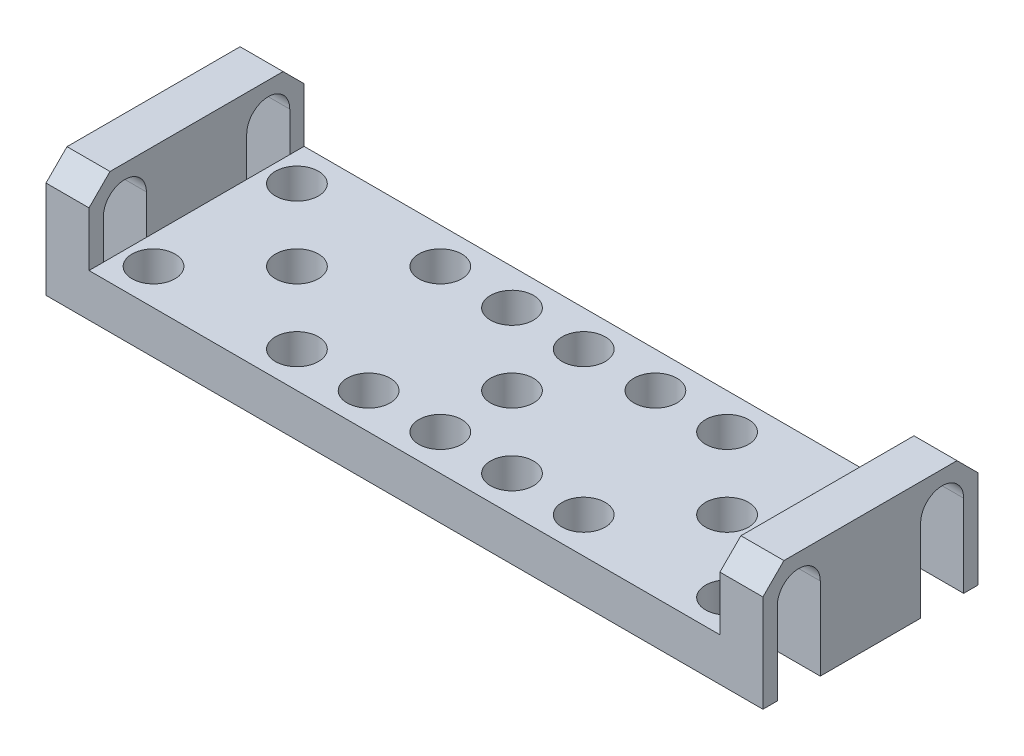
ISO-10303-21;
HEADER;
FILE_DESCRIPTION(('STEP AP214'),'2;1');
FILE_NAME('part.step','',(''),(''),'','','');
FILE_SCHEMA(('AUTOMOTIVE_DESIGN { 1 0 10303 214 1 1 1 1 }'));
ENDSEC;
DATA;
#1=APPLICATION_CONTEXT('core data for automotive mechanical design processes');
#2=APPLICATION_PROTOCOL_DEFINITION('international standard','automotive_design',2000,#1);
#3=PRODUCT_CONTEXT('',#1,'mechanical');
#4=PRODUCT('Part','Part','',(#3));
#5=PRODUCT_RELATED_PRODUCT_CATEGORY('part','',(#4));
#6=PRODUCT_DEFINITION_FORMATION('','',#4);
#7=PRODUCT_DEFINITION_CONTEXT('part definition',#1,'design');
#8=PRODUCT_DEFINITION('design','',#6,#7);
#9=PRODUCT_DEFINITION_SHAPE('','',#8);
#10=(LENGTH_UNIT() NAMED_UNIT(*) SI_UNIT(.MILLI.,.METRE.));
#11=(NAMED_UNIT(*) PLANE_ANGLE_UNIT() SI_UNIT($,.RADIAN.));
#12=(NAMED_UNIT(*) SI_UNIT($,.STERADIAN.) SOLID_ANGLE_UNIT());
#13=UNCERTAINTY_MEASURE_WITH_UNIT(LENGTH_MEASURE(1.E-05),#10,'distance_accuracy_value','');
#14=(GEOMETRIC_REPRESENTATION_CONTEXT(3) GLOBAL_UNCERTAINTY_ASSIGNED_CONTEXT((#13)) GLOBAL_UNIT_ASSIGNED_CONTEXT((#10,
#11,#12)) REPRESENTATION_CONTEXT('',''));
#15=CARTESIAN_POINT('',(0.,0.,0.));
#16=DIRECTION('',(0.,0.,1.));
#17=DIRECTION('',(1.,0.,0.));
#18=AXIS2_PLACEMENT_3D('',#15,#16,#17);
#19=CARTESIAN_POINT('',(0.,0.,0.));
#20=DIRECTION('',(0.,1.,0.));
#21=DIRECTION('',(0.,0.,1.));
#22=AXIS2_PLACEMENT_3D('',#19,#20,#21);
#23=PLANE('',#22);
#24=CARTESIAN_POINT('',(-10.,0.,5.));
#25=DIRECTION('',(0.,-1.,0.));
#26=DIRECTION('',(0.,0.,-1.));
#27=AXIS2_PLACEMENT_3D('',#24,#25,#26);
#28=CIRCLE('',#27,3.49999999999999);
#29=CARTESIAN_POINT('',(-13.1622776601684,0.,6.49999999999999));
#30=VERTEX_POINT('',#29);
#31=CARTESIAN_POINT('',(-13.1622776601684,0.,3.5));
#32=VERTEX_POINT('',#31);
#33=EDGE_CURVE('E58',#30,#32,#28,.T.);
#34=ORIENTED_EDGE('',*,*,#33,.T.);
#35=DIRECTION('',(-1.,0.,0.));
#36=VECTOR('',#35,1.);
#37=CARTESIAN_POINT('',(-16.8377223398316,0.,3.5));
#38=LINE('',#37,#36);
#39=CARTESIAN_POINT('',(-16.8377223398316,0.,3.5));
#40=VERTEX_POINT('',#39);
#41=EDGE_CURVE('E576',#32,#40,#38,.T.);
#42=ORIENTED_EDGE('',*,*,#41,.T.);
#43=CARTESIAN_POINT('',(-20.,0.,5.));
#44=DIRECTION('',(0.,-1.,0.));
#45=DIRECTION('',(0.,0.,1.));
#46=AXIS2_PLACEMENT_3D('',#43,#44,#45);
#47=CIRCLE('',#46,3.5);
#48=CARTESIAN_POINT('',(-16.8377223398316,0.,6.49999999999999));
#49=VERTEX_POINT('',#48);
#50=EDGE_CURVE('E580',#40,#49,#47,.T.);
#51=ORIENTED_EDGE('',*,*,#50,.T.);
#52=DIRECTION('',(1.,0.,0.));
#53=VECTOR('',#52,1.);
#54=CARTESIAN_POINT('',(-13.1622776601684,0.,6.49999999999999));
#55=LINE('',#54,#53);
#56=EDGE_CURVE('E568',#49,#30,#55,.T.);
#57=ORIENTED_EDGE('',*,*,#56,.T.);
#58=EDGE_LOOP('',(#34,#42,#51,#57));
#59=FACE_BOUND('',#58,.T.);
#60=CARTESIAN_POINT('',(10.,0.,-5.));
#61=DIRECTION('',(0.,-1.,0.));
#62=DIRECTION('',(0.,0.,-1.));
#63=AXIS2_PLACEMENT_3D('',#60,#61,#62);
#64=CIRCLE('',#63,3.5);
#65=CARTESIAN_POINT('',(13.1622776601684,0.,-6.49999999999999));
#66=VERTEX_POINT('',#65);
#67=CARTESIAN_POINT('',(13.1622776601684,0.,-3.5));
#68=VERTEX_POINT('',#67);
#69=EDGE_CURVE('E462',#66,#68,#64,.T.);
#70=ORIENTED_EDGE('',*,*,#69,.T.);
#71=DIRECTION('',(1.,0.,0.));
#72=VECTOR('',#71,1.);
#73=CARTESIAN_POINT('',(16.8377223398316,0.,-3.5));
#74=LINE('',#73,#72);
#75=CARTESIAN_POINT('',(16.8377223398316,0.,-3.5));
#76=VERTEX_POINT('',#75);
#77=EDGE_CURVE('E466',#68,#76,#74,.T.);
#78=ORIENTED_EDGE('',*,*,#77,.T.);
#79=CARTESIAN_POINT('',(20.,0.,-5.));
#80=DIRECTION('',(0.,-1.,0.));
#81=DIRECTION('',(0.,0.,1.));
#82=AXIS2_PLACEMENT_3D('',#79,#80,#81);
#83=CIRCLE('',#82,3.5);
#84=CARTESIAN_POINT('',(16.8377223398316,0.,-6.49999999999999));
#85=VERTEX_POINT('',#84);
#86=EDGE_CURVE('E635',#76,#85,#83,.T.);
#87=ORIENTED_EDGE('',*,*,#86,.T.);
#88=DIRECTION('',(-1.,0.,0.));
#89=VECTOR('',#88,1.);
#90=CARTESIAN_POINT('',(13.1622776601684,0.,-6.49999999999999));
#91=LINE('',#90,#89);
#92=EDGE_CURVE('E626',#85,#66,#91,.T.);
#93=ORIENTED_EDGE('',*,*,#92,.T.);
#94=EDGE_LOOP('',(#70,#78,#87,#93));
#95=FACE_BOUND('',#94,.T.);
#96=DIRECTION('',(0.,0.,1.));
#97=VECTOR('',#96,1.);
#98=CARTESIAN_POINT('',(-24.,0.,-1.5));
#99=LINE('',#98,#97);
#100=CARTESIAN_POINT('',(-24.,0.,-1.5));
#101=VERTEX_POINT('',#100);
#102=CARTESIAN_POINT('',(-24.,0.,1.5));
#103=VERTEX_POINT('',#102);
#104=EDGE_CURVE('E483',#101,#103,#99,.T.);
#105=ORIENTED_EDGE('',*,*,#104,.T.);
#106=DIRECTION('',(1.,0.,0.));
#107=VECTOR('',#106,1.);
#108=CARTESIAN_POINT('',(-24.,0.,1.5));
#109=LINE('',#108,#107);
#110=CARTESIAN_POINT('',(-18.1622776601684,0.,1.5));
#111=VERTEX_POINT('',#110);
#112=EDGE_CURVE('E486',#103,#111,#109,.T.);
#113=ORIENTED_EDGE('',*,*,#112,.T.);
#114=CARTESIAN_POINT('',(-15.,0.,0.));
#115=DIRECTION('',(0.,-1.,0.));
#116=DIRECTION('',(0.,0.,1.));
#117=AXIS2_PLACEMENT_3D('',#114,#115,#116);
#118=CIRCLE('',#117,3.5);
#119=CARTESIAN_POINT('',(-18.1622776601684,0.,-1.5));
#120=VERTEX_POINT('',#119);
#121=EDGE_CURVE('E490',#111,#120,#118,.T.);
#122=ORIENTED_EDGE('',*,*,#121,.T.);
#123=DIRECTION('',(-1.,0.,0.));
#124=VECTOR('',#123,1.);
#125=CARTESIAN_POINT('',(-24.,0.,-1.5));
#126=LINE('',#125,#124);
#127=EDGE_CURVE('E476',#120,#101,#126,.T.);
#128=ORIENTED_EDGE('',*,*,#127,.T.);
#129=EDGE_LOOP('',(#105,#113,#122,#128));
#130=FACE_BOUND('',#129,.T.);
#131=CARTESIAN_POINT('',(0.,0.,0.));
#132=DIRECTION('',(0.,-1.,0.));
#133=DIRECTION('',(0.,0.,1.));
#134=AXIS2_PLACEMENT_3D('',#131,#132,#133);
#135=CIRCLE('',#134,3.5);
#136=CARTESIAN_POINT('',(-3.16227766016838,0.,1.5));
#137=VERTEX_POINT('',#136);
#138=CARTESIAN_POINT('',(-3.16227766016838,0.,-1.5));
#139=VERTEX_POINT('',#138);
#140=EDGE_CURVE('E563',#137,#139,#135,.T.);
#141=ORIENTED_EDGE('',*,*,#140,.T.);
#142=DIRECTION('',(-1.,0.,0.));
#143=VECTOR('',#142,1.);
#144=CARTESIAN_POINT('',(-11.8377223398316,0.,-1.5));
#145=LINE('',#144,#143);
#146=CARTESIAN_POINT('',(-11.8377223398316,0.,-1.5));
#147=VERTEX_POINT('',#146);
#148=EDGE_CURVE('E661',#139,#147,#145,.T.);
#149=ORIENTED_EDGE('',*,*,#148,.T.);
#150=CARTESIAN_POINT('',(-15.,0.,0.));
#151=DIRECTION('',(0.,-1.,0.));
#152=DIRECTION('',(0.,0.,1.));
#153=AXIS2_PLACEMENT_3D('',#150,#151,#152);
#154=CIRCLE('',#153,3.5);
#155=CARTESIAN_POINT('',(-11.8377223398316,0.,1.5));
#156=VERTEX_POINT('',#155);
#157=EDGE_CURVE('E664',#147,#156,#154,.T.);
#158=ORIENTED_EDGE('',*,*,#157,.T.);
#159=DIRECTION('',(1.,0.,0.));
#160=VECTOR('',#159,1.);
#161=CARTESIAN_POINT('',(-11.8377223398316,0.,1.5));
#162=LINE('',#161,#160);
#163=EDGE_CURVE('E652',#156,#137,#162,.T.);
#164=ORIENTED_EDGE('',*,*,#163,.T.);
#165=EDGE_LOOP('',(#141,#149,#158,#164));
#166=FACE_BOUND('',#165,.T.);
#167=CARTESIAN_POINT('',(-15.,0.,0.));
#168=DIRECTION('',(0.,1.,0.));
#169=DIRECTION('',(0.,0.,-1.));
#170=AXIS2_PLACEMENT_3D('',#167,#168,#169);
#171=CIRCLE('',#170,1.5);
#172=CARTESIAN_POINT('',(-15.,0.,-1.5));
#173=VERTEX_POINT('',#172);
#174=EDGE_CURVE('E861',#173,#173,#171,.T.);
#175=ORIENTED_EDGE('',*,*,#174,.T.);
#176=EDGE_LOOP('',(#175));
#177=FACE_BOUND('',#176,.T.);
#178=CARTESIAN_POINT('',(-20.,0.,-5.));
#179=DIRECTION('',(0.,1.,0.));
#180=DIRECTION('',(0.,0.,1.));
#181=AXIS2_PLACEMENT_3D('',#178,#179,#180);
#182=CIRCLE('',#181,1.5);
#183=CARTESIAN_POINT('',(-20.,0.,-3.5));
#184=VERTEX_POINT('',#183);
#185=EDGE_CURVE('E866',#184,#184,#182,.T.);
#186=ORIENTED_EDGE('',*,*,#185,.T.);
#187=EDGE_LOOP('',(#186));
#188=FACE_BOUND('',#187,.T.);
#189=CARTESIAN_POINT('',(-20.,0.,5.));
#190=DIRECTION('',(0.,1.,0.));
#191=DIRECTION('',(0.,0.,-1.));
#192=AXIS2_PLACEMENT_3D('',#189,#190,#191);
#193=CIRCLE('',#192,1.5);
#194=CARTESIAN_POINT('',(-20.,0.,3.5));
#195=VERTEX_POINT('',#194);
#196=EDGE_CURVE('E872',#195,#195,#193,.T.);
#197=ORIENTED_EDGE('',*,*,#196,.T.);
#198=EDGE_LOOP('',(#197));
#199=FACE_BOUND('',#198,.T.);
#200=CARTESIAN_POINT('',(20.,0.,-5.));
#201=DIRECTION('',(0.,1.,0.));
#202=DIRECTION('',(0.,0.,-1.));
#203=AXIS2_PLACEMENT_3D('',#200,#201,#202);
#204=CIRCLE('',#203,1.5);
#205=CARTESIAN_POINT('',(20.,0.,-6.5));
#206=VERTEX_POINT('',#205);
#207=EDGE_CURVE('E878',#206,#206,#204,.T.);
#208=ORIENTED_EDGE('',*,*,#207,.T.);
#209=EDGE_LOOP('',(#208));
#210=FACE_BOUND('',#209,.T.);
#211=CARTESIAN_POINT('',(20.,0.,5.));
#212=DIRECTION('',(0.,1.,0.));
#213=DIRECTION('',(0.,0.,1.));
#214=AXIS2_PLACEMENT_3D('',#211,#212,#213);
#215=CIRCLE('',#214,1.5);
#216=CARTESIAN_POINT('',(20.,0.,6.5));
#217=VERTEX_POINT('',#216);
#218=EDGE_CURVE('E884',#217,#217,#215,.T.);
#219=ORIENTED_EDGE('',*,*,#218,.T.);
#220=EDGE_LOOP('',(#219));
#221=FACE_BOUND('',#220,.T.);
#222=CARTESIAN_POINT('',(15.,0.,0.));
#223=DIRECTION('',(0.,1.,0.));
#224=DIRECTION('',(0.,0.,1.));
#225=AXIS2_PLACEMENT_3D('',#222,#223,#224);
#226=CIRCLE('',#225,1.5);
#227=CARTESIAN_POINT('',(15.,0.,1.5));
#228=VERTEX_POINT('',#227);
#229=EDGE_CURVE('E890',#228,#228,#226,.T.);
#230=ORIENTED_EDGE('',*,*,#229,.T.);
#231=EDGE_LOOP('',(#230));
#232=FACE_BOUND('',#231,.T.);
#233=CARTESIAN_POINT('',(-5.,0.,-5.));
#234=DIRECTION('',(0.,1.,0.));
#235=DIRECTION('',(0.,0.,-1.));
#236=AXIS2_PLACEMENT_3D('',#233,#234,#235);
#237=CIRCLE('',#236,1.5);
#238=CARTESIAN_POINT('',(-5.,0.,-6.5));
#239=VERTEX_POINT('',#238);
#240=EDGE_CURVE('E896',#239,#239,#237,.T.);
#241=ORIENTED_EDGE('',*,*,#240,.T.);
#242=EDGE_LOOP('',(#241));
#243=FACE_BOUND('',#242,.T.);
#244=CARTESIAN_POINT('',(-10.,0.,-5.));
#245=DIRECTION('',(0.,1.,0.));
#246=DIRECTION('',(0.,0.,-1.));
#247=AXIS2_PLACEMENT_3D('',#244,#245,#246);
#248=CIRCLE('',#247,1.5);
#249=CARTESIAN_POINT('',(-10.,0.,-6.5));
#250=VERTEX_POINT('',#249);
#251=EDGE_CURVE('E902',#250,#250,#248,.T.);
#252=ORIENTED_EDGE('',*,*,#251,.T.);
#253=EDGE_LOOP('',(#252));
#254=FACE_BOUND('',#253,.T.);
#255=CARTESIAN_POINT('',(-5.,0.,5.));
#256=DIRECTION('',(0.,1.,0.));
#257=DIRECTION('',(0.,0.,1.));
#258=AXIS2_PLACEMENT_3D('',#255,#256,#257);
#259=CIRCLE('',#258,1.5);
#260=CARTESIAN_POINT('',(-5.,0.,6.5));
#261=VERTEX_POINT('',#260);
#262=EDGE_CURVE('E908',#261,#261,#259,.T.);
#263=ORIENTED_EDGE('',*,*,#262,.T.);
#264=EDGE_LOOP('',(#263));
#265=FACE_BOUND('',#264,.T.);
#266=CARTESIAN_POINT('',(-10.,0.,5.));
#267=DIRECTION('',(0.,1.,0.));
#268=DIRECTION('',(0.,0.,1.));
#269=AXIS2_PLACEMENT_3D('',#266,#267,#268);
#270=CIRCLE('',#269,1.5);
#271=CARTESIAN_POINT('',(-10.,0.,6.5));
#272=VERTEX_POINT('',#271);
#273=EDGE_CURVE('E914',#272,#272,#270,.T.);
#274=ORIENTED_EDGE('',*,*,#273,.T.);
#275=EDGE_LOOP('',(#274));
#276=FACE_BOUND('',#275,.T.);
#277=CARTESIAN_POINT('',(0.,0.,5.));
#278=DIRECTION('',(0.,1.,0.));
#279=DIRECTION('',(0.,0.,-1.));
#280=AXIS2_PLACEMENT_3D('',#277,#278,#279);
#281=CIRCLE('',#280,1.5);
#282=CARTESIAN_POINT('',(0.,0.,3.5));
#283=VERTEX_POINT('',#282);
#284=EDGE_CURVE('E920',#283,#283,#281,.T.);
#285=ORIENTED_EDGE('',*,*,#284,.T.);
#286=EDGE_LOOP('',(#285));
#287=FACE_BOUND('',#286,.T.);
#288=CARTESIAN_POINT('',(5.,0.,5.));
#289=DIRECTION('',(0.,1.,0.));
#290=DIRECTION('',(0.,0.,-1.));
#291=AXIS2_PLACEMENT_3D('',#288,#289,#290);
#292=CIRCLE('',#291,1.5);
#293=CARTESIAN_POINT('',(5.,0.,3.5));
#294=VERTEX_POINT('',#293);
#295=EDGE_CURVE('E926',#294,#294,#292,.T.);
#296=ORIENTED_EDGE('',*,*,#295,.T.);
#297=EDGE_LOOP('',(#296));
#298=FACE_BOUND('',#297,.T.);
#299=CARTESIAN_POINT('',(10.,0.,5.));
#300=DIRECTION('',(0.,1.,0.));
#301=DIRECTION('',(0.,0.,-1.));
#302=AXIS2_PLACEMENT_3D('',#299,#300,#301);
#303=CIRCLE('',#302,1.5);
#304=CARTESIAN_POINT('',(10.,0.,3.5));
#305=VERTEX_POINT('',#304);
#306=EDGE_CURVE('E932',#305,#305,#303,.T.);
#307=ORIENTED_EDGE('',*,*,#306,.T.);
#308=EDGE_LOOP('',(#307));
#309=FACE_BOUND('',#308,.T.);
#310=CARTESIAN_POINT('',(10.,0.,-5.));
#311=DIRECTION('',(0.,1.,0.));
#312=DIRECTION('',(0.,0.,1.));
#313=AXIS2_PLACEMENT_3D('',#310,#311,#312);
#314=CIRCLE('',#313,1.5);
#315=CARTESIAN_POINT('',(10.,0.,-3.5));
#316=VERTEX_POINT('',#315);
#317=EDGE_CURVE('E938',#316,#316,#314,.T.);
#318=ORIENTED_EDGE('',*,*,#317,.T.);
#319=EDGE_LOOP('',(#318));
#320=FACE_BOUND('',#319,.T.);
#321=CARTESIAN_POINT('',(5.,0.,-5.));
#322=DIRECTION('',(0.,1.,0.));
#323=DIRECTION('',(0.,0.,1.));
#324=AXIS2_PLACEMENT_3D('',#321,#322,#323);
#325=CIRCLE('',#324,1.5);
#326=CARTESIAN_POINT('',(5.,0.,-3.5));
#327=VERTEX_POINT('',#326);
#328=EDGE_CURVE('E944',#327,#327,#325,.T.);
#329=ORIENTED_EDGE('',*,*,#328,.T.);
#330=EDGE_LOOP('',(#329));
#331=FACE_BOUND('',#330,.T.);
#332=CARTESIAN_POINT('',(0.,0.,-5.));
#333=DIRECTION('',(0.,1.,0.));
#334=DIRECTION('',(0.,0.,1.));
#335=AXIS2_PLACEMENT_3D('',#332,#333,#334);
#336=CIRCLE('',#335,1.5);
#337=CARTESIAN_POINT('',(0.,0.,-3.5));
#338=VERTEX_POINT('',#337);
#339=EDGE_CURVE('E950',#338,#338,#336,.T.);
#340=ORIENTED_EDGE('',*,*,#339,.T.);
#341=EDGE_LOOP('',(#340));
#342=FACE_BOUND('',#341,.T.);
#343=CARTESIAN_POINT('',(0.,0.,0.));
#344=DIRECTION('',(0.,1.,0.));
#345=DIRECTION('',(0.,0.,1.));
#346=AXIS2_PLACEMENT_3D('',#343,#344,#345);
#347=CIRCLE('',#346,1.5);
#348=CARTESIAN_POINT('',(0.,0.,1.5));
#349=VERTEX_POINT('',#348);
#350=EDGE_CURVE('E956',#349,#349,#347,.T.);
#351=ORIENTED_EDGE('',*,*,#350,.T.);
#352=EDGE_LOOP('',(#351));
#353=FACE_BOUND('',#352,.T.);
#354=DIRECTION('',(-1.,0.,0.));
#355=VECTOR('',#354,1.);
#356=CARTESIAN_POINT('',(0.,0.,6.5));
#357=LINE('',#356,#355);
#358=CARTESIAN_POINT('',(-22.,0.,6.5));
#359=VERTEX_POINT('',#358);
#360=CARTESIAN_POINT('',(-25.,0.,6.5));
#361=VERTEX_POINT('',#360);
#362=EDGE_CURVE('E730',#359,#361,#357,.T.);
#363=ORIENTED_EDGE('',*,*,#362,.F.);
#364=DIRECTION('',(0.,0.,1.));
#365=VECTOR('',#364,1.);
#366=CARTESIAN_POINT('',(-22.,0.,0.));
#367=LINE('',#366,#365);
#368=CARTESIAN_POINT('',(-22.,0.,3.5));
#369=VERTEX_POINT('',#368);
#370=EDGE_CURVE('E11',#369,#359,#367,.T.);
#371=ORIENTED_EDGE('',*,*,#370,.F.);
#372=DIRECTION('',(1.,0.,0.));
#373=VECTOR('',#372,1.);
#374=CARTESIAN_POINT('',(0.,0.,3.5));
#375=LINE('',#374,#373);
#376=CARTESIAN_POINT('',(-25.,0.,3.5));
#377=VERTEX_POINT('',#376);
#378=EDGE_CURVE('E728',#377,#369,#375,.T.);
#379=ORIENTED_EDGE('',*,*,#378,.F.);
#380=DIRECTION('',(0.,0.,1.));
#381=VECTOR('',#380,1.);
#382=CARTESIAN_POINT('',(-25.,0.,-7.49999999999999));
#383=LINE('',#382,#381);
#384=CARTESIAN_POINT('',(-25.,0.,-3.5));
#385=VERTEX_POINT('',#384);
#386=EDGE_CURVE('E982',#385,#377,#383,.T.);
#387=ORIENTED_EDGE('',*,*,#386,.F.);
#388=DIRECTION('',(-1.,0.,0.));
#389=VECTOR('',#388,1.);
#390=CARTESIAN_POINT('',(0.,0.,-3.5));
#391=LINE('',#390,#389);
#392=CARTESIAN_POINT('',(-22.,0.,-3.5));
#393=VERTEX_POINT('',#392);
#394=EDGE_CURVE('E726',#393,#385,#391,.T.);
#395=ORIENTED_EDGE('',*,*,#394,.F.);
#396=DIRECTION('',(0.,0.,-1.));
#397=VECTOR('',#396,1.);
#398=CARTESIAN_POINT('',(-22.,0.,0.));
#399=LINE('',#398,#397);
#400=CARTESIAN_POINT('',(-22.,0.,-6.5));
#401=VERTEX_POINT('',#400);
#402=EDGE_CURVE('E43',#393,#401,#399,.T.);
#403=ORIENTED_EDGE('',*,*,#402,.T.);
#404=DIRECTION('',(1.,0.,0.));
#405=VECTOR('',#404,1.);
#406=CARTESIAN_POINT('',(0.,0.,-6.5));
#407=LINE('',#406,#405);
#408=CARTESIAN_POINT('',(-25.,0.,-6.5));
#409=VERTEX_POINT('',#408);
#410=EDGE_CURVE('E701',#409,#401,#407,.T.);
#411=ORIENTED_EDGE('',*,*,#410,.F.);
#412=CARTESIAN_POINT('',(-25.,0.,-7.49999999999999));
#413=VERTEX_POINT('',#412);
#414=EDGE_CURVE('E979',#413,#409,#383,.T.);
#415=ORIENTED_EDGE('',*,*,#414,.F.);
#416=DIRECTION('',(-1.,0.,0.));
#417=VECTOR('',#416,1.);
#418=CARTESIAN_POINT('',(-25.,0.,-7.49999999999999));
#419=LINE('',#418,#417);
#420=CARTESIAN_POINT('',(25.,0.,-7.5));
#421=VERTEX_POINT('',#420);
#422=EDGE_CURVE('E975',#421,#413,#419,.T.);
#423=ORIENTED_EDGE('',*,*,#422,.F.);
#424=DIRECTION('',(0.,0.,-1.));
#425=VECTOR('',#424,1.);
#426=CARTESIAN_POINT('',(25.,0.,-7.5));
#427=LINE('',#426,#425);
#428=CARTESIAN_POINT('',(25.,0.,-6.5));
#429=VERTEX_POINT('',#428);
#430=EDGE_CURVE('E962',#429,#421,#427,.T.);
#431=ORIENTED_EDGE('',*,*,#430,.F.);
#432=DIRECTION('',(-1.,0.,0.));
#433=VECTOR('',#432,1.);
#434=CARTESIAN_POINT('',(0.,0.,-6.5));
#435=LINE('',#434,#433);
#436=CARTESIAN_POINT('',(22.,0.,-6.5));
#437=VERTEX_POINT('',#436);
#438=EDGE_CURVE('E815',#429,#437,#435,.T.);
#439=ORIENTED_EDGE('',*,*,#438,.T.);
#440=DIRECTION('',(0.,0.,1.));
#441=VECTOR('',#440,1.);
#442=CARTESIAN_POINT('',(22.,0.,0.));
#443=LINE('',#442,#441);
#444=CARTESIAN_POINT('',(22.,0.,-3.5));
#445=VERTEX_POINT('',#444);
#446=EDGE_CURVE('E1001',#437,#445,#443,.T.);
#447=ORIENTED_EDGE('',*,*,#446,.T.);
#448=DIRECTION('',(1.,0.,0.));
#449=VECTOR('',#448,1.);
#450=CARTESIAN_POINT('',(0.,0.,-3.5));
#451=LINE('',#450,#449);
#452=CARTESIAN_POINT('',(25.,0.,-3.5));
#453=VERTEX_POINT('',#452);
#454=EDGE_CURVE('E790',#445,#453,#451,.T.);
#455=ORIENTED_EDGE('',*,*,#454,.T.);
#456=CARTESIAN_POINT('',(25.,0.,3.5));
#457=VERTEX_POINT('',#456);
#458=EDGE_CURVE('E976',#457,#453,#427,.T.);
#459=ORIENTED_EDGE('',*,*,#458,.F.);
#460=DIRECTION('',(-1.,0.,0.));
#461=VECTOR('',#460,1.);
#462=CARTESIAN_POINT('',(0.,0.,3.5));
#463=LINE('',#462,#461);
#464=CARTESIAN_POINT('',(22.,0.,3.5));
#465=VERTEX_POINT('',#464);
#466=EDGE_CURVE('E821',#457,#465,#463,.T.);
#467=ORIENTED_EDGE('',*,*,#466,.T.);
#468=DIRECTION('',(0.,0.,-1.));
#469=VECTOR('',#468,1.);
#470=CARTESIAN_POINT('',(22.,0.,0.));
#471=LINE('',#470,#469);
#472=CARTESIAN_POINT('',(22.,0.,6.5));
#473=VERTEX_POINT('',#472);
#474=EDGE_CURVE('E1004',#473,#465,#471,.T.);
#475=ORIENTED_EDGE('',*,*,#474,.F.);
#476=DIRECTION('',(1.,0.,0.));
#477=VECTOR('',#476,1.);
#478=CARTESIAN_POINT('',(0.,0.,6.5));
#479=LINE('',#478,#477);
#480=CARTESIAN_POINT('',(25.,0.,6.5));
#481=VERTEX_POINT('',#480);
#482=EDGE_CURVE('E818',#473,#481,#479,.T.);
#483=ORIENTED_EDGE('',*,*,#482,.T.);
#484=CARTESIAN_POINT('',(25.,0.,7.5));
#485=VERTEX_POINT('',#484);
#486=EDGE_CURVE('E972',#485,#481,#427,.T.);
#487=ORIENTED_EDGE('',*,*,#486,.F.);
#488=DIRECTION('',(1.,0.,0.));
#489=VECTOR('',#488,1.);
#490=CARTESIAN_POINT('',(-25.,0.,7.50000000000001));
#491=LINE('',#490,#489);
#492=CARTESIAN_POINT('',(-25.,0.,7.50000000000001));
#493=VERTEX_POINT('',#492);
#494=EDGE_CURVE('E969',#493,#485,#491,.T.);
#495=ORIENTED_EDGE('',*,*,#494,.F.);
#496=EDGE_CURVE('E978',#361,#493,#383,.T.);
#497=ORIENTED_EDGE('',*,*,#496,.F.);
#498=EDGE_LOOP('',(#363,#371,#379,#387,#395,#403,#411,#415,#423,#431,#439,#447,#455,#459,#467,
#475,#483,#487,#495,#497));
#499=FACE_BOUND('',#498,.T.);
#500=CARTESIAN_POINT('',(15.,0.,0.));
#501=DIRECTION('',(0.,-1.,0.));
#502=DIRECTION('',(0.,0.,-1.));
#503=AXIS2_PLACEMENT_3D('',#500,#501,#502);
#504=CIRCLE('',#503,3.5);
#505=CARTESIAN_POINT('',(18.1622776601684,0.,-1.5));
#506=VERTEX_POINT('',#505);
#507=CARTESIAN_POINT('',(18.1622776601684,0.,1.5));
#508=VERTEX_POINT('',#507);
#509=EDGE_CURVE('E516',#506,#508,#504,.T.);
#510=ORIENTED_EDGE('',*,*,#509,.T.);
#511=DIRECTION('',(1.,0.,0.));
#512=VECTOR('',#511,1.);
#513=CARTESIAN_POINT('',(24.,0.,1.5));
#514=LINE('',#513,#512);
#515=CARTESIAN_POINT('',(24.,0.,1.5));
#516=VERTEX_POINT('',#515);
#517=EDGE_CURVE('E519',#508,#516,#514,.T.);
#518=ORIENTED_EDGE('',*,*,#517,.T.);
#519=DIRECTION('',(0.,0.,-1.));
#520=VECTOR('',#519,1.);
#521=CARTESIAN_POINT('',(24.,0.,-1.5));
#522=LINE('',#521,#520);
#523=CARTESIAN_POINT('',(24.,0.,-1.5));
#524=VERTEX_POINT('',#523);
#525=EDGE_CURVE('E522',#516,#524,#522,.T.);
#526=ORIENTED_EDGE('',*,*,#525,.T.);
#527=DIRECTION('',(-1.,0.,0.));
#528=VECTOR('',#527,1.);
#529=CARTESIAN_POINT('',(24.,0.,-1.5));
#530=LINE('',#529,#528);
#531=EDGE_CURVE('E509',#524,#506,#530,.T.);
#532=ORIENTED_EDGE('',*,*,#531,.T.);
#533=EDGE_LOOP('',(#510,#518,#526,#532));
#534=FACE_BOUND('',#533,.T.);
#535=CARTESIAN_POINT('',(15.,0.,0.));
#536=DIRECTION('',(0.,-1.,0.));
#537=DIRECTION('',(0.,0.,-1.));
#538=AXIS2_PLACEMENT_3D('',#535,#536,#537);
#539=CIRCLE('',#538,3.5);
#540=CARTESIAN_POINT('',(11.8377223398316,0.,1.5));
#541=VERTEX_POINT('',#540);
#542=CARTESIAN_POINT('',(11.8377223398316,0.,-1.5));
#543=VERTEX_POINT('',#542);
#544=EDGE_CURVE('E504',#541,#543,#539,.T.);
#545=ORIENTED_EDGE('',*,*,#544,.T.);
#546=DIRECTION('',(-1.,0.,0.));
#547=VECTOR('',#546,1.);
#548=CARTESIAN_POINT('',(11.8377223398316,0.,-1.5));
#549=LINE('',#548,#547);
#550=CARTESIAN_POINT('',(3.16227766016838,0.,-1.5));
#551=VERTEX_POINT('',#550);
#552=EDGE_CURVE('E461',#543,#551,#549,.T.);
#553=ORIENTED_EDGE('',*,*,#552,.T.);
#554=CARTESIAN_POINT('',(0.,0.,0.));
#555=DIRECTION('',(0.,-1.,0.));
#556=DIRECTION('',(0.,0.,-1.));
#557=AXIS2_PLACEMENT_3D('',#554,#555,#556);
#558=CIRCLE('',#557,3.5);
#559=CARTESIAN_POINT('',(3.16227766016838,0.,1.5));
#560=VERTEX_POINT('',#559);
#561=EDGE_CURVE('E2110',#551,#560,#558,.T.);
#562=ORIENTED_EDGE('',*,*,#561,.T.);
#563=DIRECTION('',(1.,0.,0.));
#564=VECTOR('',#563,1.);
#565=CARTESIAN_POINT('',(11.8377223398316,0.,1.5));
#566=LINE('',#565,#564);
#567=EDGE_CURVE('E457',#560,#541,#566,.T.);
#568=ORIENTED_EDGE('',*,*,#567,.T.);
#569=EDGE_LOOP('',(#545,#553,#562,#568));
#570=FACE_BOUND('',#569,.T.);
#571=CARTESIAN_POINT('',(20.,0.,5.));
#572=DIRECTION('',(0.,-1.,0.));
#573=DIRECTION('',(0.,0.,-1.));
#574=AXIS2_PLACEMENT_3D('',#571,#572,#573);
#575=CIRCLE('',#574,3.5);
#576=CARTESIAN_POINT('',(16.8377223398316,0.,6.49999999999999));
#577=VERTEX_POINT('',#576);
#578=CARTESIAN_POINT('',(16.8377223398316,0.,3.5));
#579=VERTEX_POINT('',#578);
#580=EDGE_CURVE('E602',#577,#579,#575,.T.);
#581=ORIENTED_EDGE('',*,*,#580,.T.);
#582=DIRECTION('',(-1.,0.,0.));
#583=VECTOR('',#582,1.);
#584=CARTESIAN_POINT('',(16.8377223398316,0.,3.5));
#585=LINE('',#584,#583);
#586=CARTESIAN_POINT('',(13.1622776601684,0.,3.5));
#587=VERTEX_POINT('',#586);
#588=EDGE_CURVE('E605',#579,#587,#585,.T.);
#589=ORIENTED_EDGE('',*,*,#588,.T.);
#590=CARTESIAN_POINT('',(10.,0.,5.));
#591=DIRECTION('',(0.,-1.,0.));
#592=DIRECTION('',(0.,0.,1.));
#593=AXIS2_PLACEMENT_3D('',#590,#591,#592);
#594=CIRCLE('',#593,3.49999999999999);
#595=CARTESIAN_POINT('',(13.1622776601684,0.,6.49999999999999));
#596=VERTEX_POINT('',#595);
#597=EDGE_CURVE('E609',#587,#596,#594,.T.);
#598=ORIENTED_EDGE('',*,*,#597,.T.);
#599=DIRECTION('',(1.,0.,0.));
#600=VECTOR('',#599,1.);
#601=CARTESIAN_POINT('',(13.1622776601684,0.,6.49999999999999));
#602=LINE('',#601,#600);
#603=EDGE_CURVE('E595',#596,#577,#602,.T.);
#604=ORIENTED_EDGE('',*,*,#603,.T.);
#605=EDGE_LOOP('',(#581,#589,#598,#604));
#606=FACE_BOUND('',#605,.T.);
#607=CARTESIAN_POINT('',(-20.,0.,-5.));
#608=DIRECTION('',(0.,-1.,0.));
#609=DIRECTION('',(0.,0.,-1.));
#610=AXIS2_PLACEMENT_3D('',#607,#608,#609);
#611=CIRCLE('',#610,3.5);
#612=CARTESIAN_POINT('',(-16.8377223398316,0.,-6.49999999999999));
#613=VERTEX_POINT('',#612);
#614=CARTESIAN_POINT('',(-16.8377223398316,0.,-3.5));
#615=VERTEX_POINT('',#614);
#616=EDGE_CURVE('E50',#613,#615,#611,.T.);
#617=ORIENTED_EDGE('',*,*,#616,.T.);
#618=DIRECTION('',(1.,0.,0.));
#619=VECTOR('',#618,1.);
#620=CARTESIAN_POINT('',(-16.8377223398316,0.,-3.5));
#621=LINE('',#620,#619);
#622=CARTESIAN_POINT('',(-13.1622776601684,0.,-3.5));
#623=VERTEX_POINT('',#622);
#624=EDGE_CURVE('E547',#615,#623,#621,.T.);
#625=ORIENTED_EDGE('',*,*,#624,.T.);
#626=CARTESIAN_POINT('',(-10.,0.,-5.));
#627=DIRECTION('',(0.,-1.,0.));
#628=DIRECTION('',(0.,0.,1.));
#629=AXIS2_PLACEMENT_3D('',#626,#627,#628);
#630=CIRCLE('',#629,3.5);
#631=CARTESIAN_POINT('',(-13.1622776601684,0.,-6.49999999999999));
#632=VERTEX_POINT('',#631);
#633=EDGE_CURVE('E551',#623,#632,#630,.T.);
#634=ORIENTED_EDGE('',*,*,#633,.T.);
#635=DIRECTION('',(-1.,0.,0.));
#636=VECTOR('',#635,1.);
#637=CARTESIAN_POINT('',(-13.1622776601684,0.,-6.49999999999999));
#638=LINE('',#637,#636);
#639=EDGE_CURVE('E539',#632,#613,#638,.T.);
#640=ORIENTED_EDGE('',*,*,#639,.T.);
#641=EDGE_LOOP('',(#617,#625,#634,#640));
#642=FACE_BOUND('',#641,.T.);
#643=ADVANCED_FACE('F35',(#59,#95,#130,#166,#177,#188,#199,#210,#221,#232,#243,#254,#265,#276,
#287,#298,#309,#320,#331,#342,#353,#499,#534,#570,#606,#642),#23,.F.);
#644=CARTESIAN_POINT('',(-25.,3.,-7.49999999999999));
#645=DIRECTION('',(1.,0.,0.));
#646=DIRECTION('',(0.,0.,-1.));
#647=AXIS2_PLACEMENT_3D('',#644,#645,#646);
#648=PLANE('',#647);
#649=DIRECTION('',(0.,-1.,0.));
#650=VECTOR('',#649,1.);
#651=CARTESIAN_POINT('',(-25.,5.75,6.5));
#652=LINE('',#651,#650);
#653=CARTESIAN_POINT('',(-25.,5.75,6.5));
#654=VERTEX_POINT('',#653);
#655=EDGE_CURVE('E682',#654,#361,#652,.T.);
#656=ORIENTED_EDGE('',*,*,#655,.T.);
#657=ORIENTED_EDGE('',*,*,#496,.T.);
#658=DIRECTION('',(0.,-1.,0.));
#659=VECTOR('',#658,1.);
#660=CARTESIAN_POINT('',(-25.,3.,7.50000000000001));
#661=LINE('',#660,#659);
#662=CARTESIAN_POINT('',(-25.,6.78553390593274,7.5));
#663=VERTEX_POINT('',#662);
#664=EDGE_CURVE('E986',#663,#493,#661,.T.);
#665=ORIENTED_EDGE('',*,*,#664,.F.);
#666=DIRECTION('',(0.,-0.707106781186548,0.707106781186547));
#667=VECTOR('',#666,1.);
#668=CARTESIAN_POINT('',(-25.,8.25,6.03553390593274));
#669=LINE('',#668,#667);
#670=CARTESIAN_POINT('',(-25.,8.25,6.03553390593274));
#671=VERTEX_POINT('',#670);
#672=EDGE_CURVE('E732',#671,#663,#669,.T.);
#673=ORIENTED_EDGE('',*,*,#672,.F.);
#674=DIRECTION('',(0.,0.,1.));
#675=VECTOR('',#674,1.);
#676=CARTESIAN_POINT('',(-25.,8.25,-6.03553390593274));
#677=LINE('',#676,#675);
#678=CARTESIAN_POINT('',(-25.,8.25,-6.03553390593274));
#679=VERTEX_POINT('',#678);
#680=EDGE_CURVE('E737',#679,#671,#677,.T.);
#681=ORIENTED_EDGE('',*,*,#680,.F.);
#682=DIRECTION('',(0.,0.707106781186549,0.707106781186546));
#683=VECTOR('',#682,1.);
#684=CARTESIAN_POINT('',(-25.,8.25,-6.03553390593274));
#685=LINE('',#684,#683);
#686=CARTESIAN_POINT('',(-25.,6.78553390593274,-7.5));
#687=VERTEX_POINT('',#686);
#688=EDGE_CURVE('E749',#687,#679,#685,.T.);
#689=ORIENTED_EDGE('',*,*,#688,.F.);
#690=DIRECTION('',(0.,-1.,0.));
#691=VECTOR('',#690,1.);
#692=CARTESIAN_POINT('',(-25.,3.,-7.49999999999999));
#693=LINE('',#692,#691);
#694=EDGE_CURVE('E989',#687,#413,#693,.T.);
#695=ORIENTED_EDGE('',*,*,#694,.T.);
#696=ORIENTED_EDGE('',*,*,#414,.T.);
#697=DIRECTION('',(0.,1.,0.));
#698=VECTOR('',#697,1.);
#699=CARTESIAN_POINT('',(-25.,5.75,-6.5));
#700=LINE('',#699,#698);
#701=CARTESIAN_POINT('',(-25.,5.75,-6.5));
#702=VERTEX_POINT('',#701);
#703=EDGE_CURVE('E716',#409,#702,#700,.T.);
#704=ORIENTED_EDGE('',*,*,#703,.T.);
#705=CARTESIAN_POINT('',(-25.,5.75,-5.));
#706=DIRECTION('',(1.,0.,0.));
#707=DIRECTION('',(0.,0.,1.));
#708=AXIS2_PLACEMENT_3D('',#705,#706,#707);
#709=CIRCLE('',#708,1.5);
#710=CARTESIAN_POINT('',(-25.,5.75,-3.5));
#711=VERTEX_POINT('',#710);
#712=EDGE_CURVE('E678',#702,#711,#709,.T.);
#713=ORIENTED_EDGE('',*,*,#712,.T.);
#714=DIRECTION('',(0.,-1.,0.));
#715=VECTOR('',#714,1.);
#716=CARTESIAN_POINT('',(-25.,5.75,-3.5));
#717=LINE('',#716,#715);
#718=EDGE_CURVE('E707',#711,#385,#717,.T.);
#719=ORIENTED_EDGE('',*,*,#718,.T.);
#720=ORIENTED_EDGE('',*,*,#386,.T.);
#721=DIRECTION('',(0.,1.,0.));
#722=VECTOR('',#721,1.);
#723=CARTESIAN_POINT('',(-25.,5.75,3.5));
#724=LINE('',#723,#722);
#725=CARTESIAN_POINT('',(-25.,5.75,3.5));
#726=VERTEX_POINT('',#725);
#727=EDGE_CURVE('E692',#377,#726,#724,.T.);
#728=ORIENTED_EDGE('',*,*,#727,.T.);
#729=CARTESIAN_POINT('',(-25.,5.75,5.));
#730=DIRECTION('',(1.,0.,0.));
#731=DIRECTION('',(0.,0.,-1.));
#732=AXIS2_PLACEMENT_3D('',#729,#730,#731);
#733=CIRCLE('',#732,1.5);
#734=EDGE_CURVE('E689',#726,#654,#733,.T.);
#735=ORIENTED_EDGE('',*,*,#734,.T.);
#736=EDGE_LOOP('',(#656,#657,#665,#673,#681,#689,#695,#696,#704,#713,#719,#720,#728,#735));
#737=FACE_BOUND('',#736,.T.);
#738=ADVANCED_FACE('F1098',(#737),#648,.F.);
#739=CARTESIAN_POINT('',(-22.,0.,0.));
#740=DIRECTION('',(1.,0.,0.));
#741=DIRECTION('',(0.,0.,-1.));
#742=AXIS2_PLACEMENT_3D('',#739,#740,#741);
#743=PLANE('',#742);
#744=DIRECTION('',(0.,0.,-1.));
#745=VECTOR('',#744,1.);
#746=CARTESIAN_POINT('',(-22.,3.,0.));
#747=LINE('',#746,#745);
#748=CARTESIAN_POINT('',(-22.,3.,7.50000000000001));
#749=VERTEX_POINT('',#748);
#750=CARTESIAN_POINT('',(-22.,3.,6.5));
#751=VERTEX_POINT('',#750);
#752=EDGE_CURVE('E764',#749,#751,#747,.T.);
#753=ORIENTED_EDGE('',*,*,#752,.T.);
#754=DIRECTION('',(0.,-1.,0.));
#755=VECTOR('',#754,1.);
#756=CARTESIAN_POINT('',(-22.,5.75,6.5));
#757=LINE('',#756,#755);
#758=CARTESIAN_POINT('',(-22.,5.75,6.5));
#759=VERTEX_POINT('',#758);
#760=EDGE_CURVE('E685',#759,#751,#757,.T.);
#761=ORIENTED_EDGE('',*,*,#760,.F.);
#762=CARTESIAN_POINT('',(-22.,5.75,5.));
#763=DIRECTION('',(1.,0.,0.));
#764=DIRECTION('',(0.,0.,-1.));
#765=AXIS2_PLACEMENT_3D('',#762,#763,#764);
#766=CIRCLE('',#765,1.5);
#767=CARTESIAN_POINT('',(-22.,5.75,3.5));
#768=VERTEX_POINT('',#767);
#769=EDGE_CURVE('E679',#768,#759,#766,.T.);
#770=ORIENTED_EDGE('',*,*,#769,.F.);
#771=DIRECTION('',(0.,-1.,0.));
#772=VECTOR('',#771,1.);
#773=CARTESIAN_POINT('',(-22.,0.,3.5));
#774=LINE('',#773,#772);
#775=CARTESIAN_POINT('',(-22.,3.,3.5));
#776=VERTEX_POINT('',#775);
#777=EDGE_CURVE('E1009',#768,#776,#774,.T.);
#778=ORIENTED_EDGE('',*,*,#777,.T.);
#779=CARTESIAN_POINT('',(-22.,3.,-3.5));
#780=VERTEX_POINT('',#779);
#781=EDGE_CURVE('E1039',#776,#780,#747,.T.);
#782=ORIENTED_EDGE('',*,*,#781,.T.);
#783=DIRECTION('',(0.,-1.,0.));
#784=VECTOR('',#783,1.);
#785=CARTESIAN_POINT('',(-22.,5.75,-3.5));
#786=LINE('',#785,#784);
#787=CARTESIAN_POINT('',(-22.,5.75,-3.5));
#788=VERTEX_POINT('',#787);
#789=EDGE_CURVE('E710',#788,#780,#786,.T.);
#790=ORIENTED_EDGE('',*,*,#789,.F.);
#791=CARTESIAN_POINT('',(-22.,5.75,-5.));
#792=DIRECTION('',(1.,0.,0.));
#793=DIRECTION('',(0.,0.,1.));
#794=AXIS2_PLACEMENT_3D('',#791,#792,#793);
#795=CIRCLE('',#794,1.5);
#796=CARTESIAN_POINT('',(-22.,5.75,-6.5));
#797=VERTEX_POINT('',#796);
#798=EDGE_CURVE('E704',#797,#788,#795,.T.);
#799=ORIENTED_EDGE('',*,*,#798,.F.);
#800=DIRECTION('',(0.,-1.,0.));
#801=VECTOR('',#800,1.);
#802=CARTESIAN_POINT('',(-22.,0.,-6.5));
#803=LINE('',#802,#801);
#804=CARTESIAN_POINT('',(-22.,3.,-6.5));
#805=VERTEX_POINT('',#804);
#806=EDGE_CURVE('E1006',#797,#805,#803,.T.);
#807=ORIENTED_EDGE('',*,*,#806,.T.);
#808=CARTESIAN_POINT('',(-22.,3.,-7.49999999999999));
#809=VERTEX_POINT('',#808);
#810=EDGE_CURVE('E763',#805,#809,#747,.T.);
#811=ORIENTED_EDGE('',*,*,#810,.T.);
#812=DIRECTION('',(0.,1.,0.));
#813=VECTOR('',#812,1.);
#814=CARTESIAN_POINT('',(-22.,0.,-7.5));
#815=LINE('',#814,#813);
#816=CARTESIAN_POINT('',(-22.,6.78553390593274,-7.5));
#817=VERTEX_POINT('',#816);
#818=EDGE_CURVE('E740',#809,#817,#815,.T.);
#819=ORIENTED_EDGE('',*,*,#818,.T.);
#820=DIRECTION('',(0.,0.707106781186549,0.707106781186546));
#821=VECTOR('',#820,1.);
#822=CARTESIAN_POINT('',(-22.,8.25,-6.03553390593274));
#823=LINE('',#822,#821);
#824=CARTESIAN_POINT('',(-22.,8.25,-6.03553390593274));
#825=VERTEX_POINT('',#824);
#826=EDGE_CURVE('E742',#817,#825,#823,.T.);
#827=ORIENTED_EDGE('',*,*,#826,.T.);
#828=DIRECTION('',(0.,0.,1.));
#829=VECTOR('',#828,1.);
#830=CARTESIAN_POINT('',(-22.,8.25,-6.03553390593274));
#831=LINE('',#830,#829);
#832=CARTESIAN_POINT('',(-22.,8.25,6.03553390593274));
#833=VERTEX_POINT('',#832);
#834=EDGE_CURVE('E744',#825,#833,#831,.T.);
#835=ORIENTED_EDGE('',*,*,#834,.T.);
#836=DIRECTION('',(0.,-0.707106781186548,0.707106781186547));
#837=VECTOR('',#836,1.);
#838=CARTESIAN_POINT('',(-22.,8.25,6.03553390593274));
#839=LINE('',#838,#837);
#840=CARTESIAN_POINT('',(-22.,6.78553390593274,7.5));
#841=VERTEX_POINT('',#840);
#842=EDGE_CURVE('E733',#833,#841,#839,.T.);
#843=ORIENTED_EDGE('',*,*,#842,.T.);
#844=DIRECTION('',(0.,-1.,0.));
#845=VECTOR('',#844,1.);
#846=CARTESIAN_POINT('',(-22.,6.78553390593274,7.5));
#847=LINE('',#846,#845);
#848=EDGE_CURVE('E736',#841,#749,#847,.T.);
#849=ORIENTED_EDGE('',*,*,#848,.T.);
#850=EDGE_LOOP('',(#753,#761,#770,#778,#782,#790,#799,#807,#811,#819,#827,#835,#843,#849));
#851=FACE_BOUND('',#850,.T.);
#852=ADVANCED_FACE('F1040',(#851),#743,.T.);
#853=CARTESIAN_POINT('',(0.,3.,0.));
#854=DIRECTION('',(0.,1.,0.));
#855=DIRECTION('',(0.,0.,1.));
#856=AXIS2_PLACEMENT_3D('',#853,#854,#855);
#857=PLANE('',#856);
#858=ORIENTED_EDGE('',*,*,#752,.F.);
#859=DIRECTION('',(1.,0.,0.));
#860=VECTOR('',#859,1.);
#861=CARTESIAN_POINT('',(-25.,3.,7.50000000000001));
#862=LINE('',#861,#860);
#863=CARTESIAN_POINT('',(22.,3.,7.5));
#864=VERTEX_POINT('',#863);
#865=EDGE_CURVE('E968',#749,#864,#862,.T.);
#866=ORIENTED_EDGE('',*,*,#865,.T.);
#867=DIRECTION('',(0.,0.,-1.));
#868=VECTOR('',#867,1.);
#869=CARTESIAN_POINT('',(22.,3.,0.));
#870=LINE('',#869,#868);
#871=CARTESIAN_POINT('',(22.,3.,6.5));
#872=VERTEX_POINT('',#871);
#873=EDGE_CURVE('E858',#864,#872,#870,.T.);
#874=ORIENTED_EDGE('',*,*,#873,.T.);
#875=CARTESIAN_POINT('',(22.,3.,3.5));
#876=VERTEX_POINT('',#875);
#877=EDGE_CURVE('E862',#872,#876,#870,.T.);
#878=ORIENTED_EDGE('',*,*,#877,.T.);
#879=CARTESIAN_POINT('',(22.,3.,-3.5));
#880=VERTEX_POINT('',#879);
#881=EDGE_CURVE('E1073',#876,#880,#870,.T.);
#882=ORIENTED_EDGE('',*,*,#881,.T.);
#883=CARTESIAN_POINT('',(22.,3.,-6.5));
#884=VERTEX_POINT('',#883);
#885=EDGE_CURVE('E1074',#880,#884,#870,.T.);
#886=ORIENTED_EDGE('',*,*,#885,.T.);
#887=CARTESIAN_POINT('',(22.,3.,-7.5));
#888=VERTEX_POINT('',#887);
#889=EDGE_CURVE('E850',#884,#888,#870,.T.);
#890=ORIENTED_EDGE('',*,*,#889,.T.);
#891=DIRECTION('',(-1.,0.,0.));
#892=VECTOR('',#891,1.);
#893=CARTESIAN_POINT('',(-25.,3.,-7.49999999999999));
#894=LINE('',#893,#892);
#895=EDGE_CURVE('E965',#888,#809,#894,.T.);
#896=ORIENTED_EDGE('',*,*,#895,.T.);
#897=ORIENTED_EDGE('',*,*,#810,.F.);
#898=EDGE_CURVE('E1035',#780,#805,#747,.T.);
#899=ORIENTED_EDGE('',*,*,#898,.F.);
#900=ORIENTED_EDGE('',*,*,#781,.F.);
#901=EDGE_CURVE('E768',#751,#776,#747,.T.);
#902=ORIENTED_EDGE('',*,*,#901,.F.);
#903=EDGE_LOOP('',(#858,#866,#874,#878,#882,#886,#890,#896,#897,#899,#900,#902));
#904=FACE_BOUND('',#903,.T.);
#905=CARTESIAN_POINT('',(-20.,3.,-5.));
#906=DIRECTION('',(0.,1.,0.));
#907=DIRECTION('',(0.,0.,1.));
#908=AXIS2_PLACEMENT_3D('',#905,#906,#907);
#909=CIRCLE('',#908,1.5);
#910=CARTESIAN_POINT('',(-20.,3.,-3.5));
#911=VERTEX_POINT('',#910);
#912=EDGE_CURVE('E869',#911,#911,#909,.T.);
#913=ORIENTED_EDGE('',*,*,#912,.F.);
#914=EDGE_LOOP('',(#913));
#915=FACE_BOUND('',#914,.T.);
#916=CARTESIAN_POINT('',(20.,3.,-5.));
#917=DIRECTION('',(0.,1.,0.));
#918=DIRECTION('',(0.,0.,-1.));
#919=AXIS2_PLACEMENT_3D('',#916,#917,#918);
#920=CIRCLE('',#919,1.5);
#921=CARTESIAN_POINT('',(20.,3.,-6.5));
#922=VERTEX_POINT('',#921);
#923=EDGE_CURVE('E881',#922,#922,#920,.T.);
#924=ORIENTED_EDGE('',*,*,#923,.F.);
#925=EDGE_LOOP('',(#924));
#926=FACE_BOUND('',#925,.T.);
#927=CARTESIAN_POINT('',(15.,3.,0.));
#928=DIRECTION('',(0.,1.,0.));
#929=DIRECTION('',(0.,0.,1.));
#930=AXIS2_PLACEMENT_3D('',#927,#928,#929);
#931=CIRCLE('',#930,1.5);
#932=CARTESIAN_POINT('',(15.,3.,1.5));
#933=VERTEX_POINT('',#932);
#934=EDGE_CURVE('E893',#933,#933,#931,.T.);
#935=ORIENTED_EDGE('',*,*,#934,.F.);
#936=EDGE_LOOP('',(#935));
#937=FACE_BOUND('',#936,.T.);
#938=CARTESIAN_POINT('',(-10.,3.,-5.));
#939=DIRECTION('',(0.,1.,0.));
#940=DIRECTION('',(0.,0.,-1.));
#941=AXIS2_PLACEMENT_3D('',#938,#939,#940);
#942=CIRCLE('',#941,1.5);
#943=CARTESIAN_POINT('',(-10.,3.,-6.5));
#944=VERTEX_POINT('',#943);
#945=EDGE_CURVE('E905',#944,#944,#942,.T.);
#946=ORIENTED_EDGE('',*,*,#945,.F.);
#947=EDGE_LOOP('',(#946));
#948=FACE_BOUND('',#947,.T.);
#949=CARTESIAN_POINT('',(-10.,3.,5.));
#950=DIRECTION('',(0.,1.,0.));
#951=DIRECTION('',(0.,0.,1.));
#952=AXIS2_PLACEMENT_3D('',#949,#950,#951);
#953=CIRCLE('',#952,1.5);
#954=CARTESIAN_POINT('',(-10.,3.,6.5));
#955=VERTEX_POINT('',#954);
#956=EDGE_CURVE('E917',#955,#955,#953,.T.);
#957=ORIENTED_EDGE('',*,*,#956,.F.);
#958=EDGE_LOOP('',(#957));
#959=FACE_BOUND('',#958,.T.);
#960=CARTESIAN_POINT('',(5.,3.,5.));
#961=DIRECTION('',(0.,1.,0.));
#962=DIRECTION('',(0.,0.,-1.));
#963=AXIS2_PLACEMENT_3D('',#960,#961,#962);
#964=CIRCLE('',#963,1.5);
#965=CARTESIAN_POINT('',(5.,3.,3.5));
#966=VERTEX_POINT('',#965);
#967=EDGE_CURVE('E929',#966,#966,#964,.T.);
#968=ORIENTED_EDGE('',*,*,#967,.F.);
#969=EDGE_LOOP('',(#968));
#970=FACE_BOUND('',#969,.T.);
#971=CARTESIAN_POINT('',(10.,3.,-5.));
#972=DIRECTION('',(0.,1.,0.));
#973=DIRECTION('',(0.,0.,1.));
#974=AXIS2_PLACEMENT_3D('',#971,#972,#973);
#975=CIRCLE('',#974,1.5);
#976=CARTESIAN_POINT('',(10.,3.,-3.5));
#977=VERTEX_POINT('',#976);
#978=EDGE_CURVE('E941',#977,#977,#975,.T.);
#979=ORIENTED_EDGE('',*,*,#978,.F.);
#980=EDGE_LOOP('',(#979));
#981=FACE_BOUND('',#980,.T.);
#982=CARTESIAN_POINT('',(0.,3.,-5.));
#983=DIRECTION('',(0.,1.,0.));
#984=DIRECTION('',(0.,0.,1.));
#985=AXIS2_PLACEMENT_3D('',#982,#983,#984);
#986=CIRCLE('',#985,1.5);
#987=CARTESIAN_POINT('',(0.,3.,-3.5));
#988=VERTEX_POINT('',#987);
#989=EDGE_CURVE('E953',#988,#988,#986,.T.);
#990=ORIENTED_EDGE('',*,*,#989,.F.);
#991=EDGE_LOOP('',(#990));
#992=FACE_BOUND('',#991,.T.);
#993=CARTESIAN_POINT('',(0.,3.,0.));
#994=DIRECTION('',(0.,1.,0.));
#995=DIRECTION('',(0.,0.,1.));
#996=AXIS2_PLACEMENT_3D('',#993,#994,#995);
#997=CIRCLE('',#996,1.5);
#998=CARTESIAN_POINT('',(0.,3.,1.5));
#999=VERTEX_POINT('',#998);
#1000=EDGE_CURVE('E959',#999,#999,#997,.T.);
#1001=ORIENTED_EDGE('',*,*,#1000,.F.);
#1002=EDGE_LOOP('',(#1001));
#1003=FACE_BOUND('',#1002,.T.);
#1004=CARTESIAN_POINT('',(5.,3.,-5.));
#1005=DIRECTION('',(0.,1.,0.));
#1006=DIRECTION('',(0.,0.,1.));
#1007=AXIS2_PLACEMENT_3D('',#1004,#1005,#1006);
#1008=CIRCLE('',#1007,1.5);
#1009=CARTESIAN_POINT('',(5.,3.,-3.5));
#1010=VERTEX_POINT('',#1009);
#1011=EDGE_CURVE('E947',#1010,#1010,#1008,.T.);
#1012=ORIENTED_EDGE('',*,*,#1011,.F.);
#1013=EDGE_LOOP('',(#1012));
#1014=FACE_BOUND('',#1013,.T.);
#1015=CARTESIAN_POINT('',(10.,3.,5.));
#1016=DIRECTION('',(0.,1.,0.));
#1017=DIRECTION('',(0.,0.,-1.));
#1018=AXIS2_PLACEMENT_3D('',#1015,#1016,#1017);
#1019=CIRCLE('',#1018,1.5);
#1020=CARTESIAN_POINT('',(10.,3.,3.5));
#1021=VERTEX_POINT('',#1020);
#1022=EDGE_CURVE('E935',#1021,#1021,#1019,.T.);
#1023=ORIENTED_EDGE('',*,*,#1022,.F.);
#1024=EDGE_LOOP('',(#1023));
#1025=FACE_BOUND('',#1024,.T.);
#1026=CARTESIAN_POINT('',(0.,3.,5.));
#1027=DIRECTION('',(0.,1.,0.));
#1028=DIRECTION('',(0.,0.,-1.));
#1029=AXIS2_PLACEMENT_3D('',#1026,#1027,#1028);
#1030=CIRCLE('',#1029,1.5);
#1031=CARTESIAN_POINT('',(0.,3.,3.5));
#1032=VERTEX_POINT('',#1031);
#1033=EDGE_CURVE('E923',#1032,#1032,#1030,.T.);
#1034=ORIENTED_EDGE('',*,*,#1033,.F.);
#1035=EDGE_LOOP('',(#1034));
#1036=FACE_BOUND('',#1035,.T.);
#1037=CARTESIAN_POINT('',(-5.,3.,5.));
#1038=DIRECTION('',(0.,1.,0.));
#1039=DIRECTION('',(0.,0.,1.));
#1040=AXIS2_PLACEMENT_3D('',#1037,#1038,#1039);
#1041=CIRCLE('',#1040,1.5);
#1042=CARTESIAN_POINT('',(-5.,3.,6.5));
#1043=VERTEX_POINT('',#1042);
#1044=EDGE_CURVE('E911',#1043,#1043,#1041,.T.);
#1045=ORIENTED_EDGE('',*,*,#1044,.F.);
#1046=EDGE_LOOP('',(#1045));
#1047=FACE_BOUND('',#1046,.T.);
#1048=CARTESIAN_POINT('',(-5.,3.,-5.));
#1049=DIRECTION('',(0.,1.,0.));
#1050=DIRECTION('',(0.,0.,-1.));
#1051=AXIS2_PLACEMENT_3D('',#1048,#1049,#1050);
#1052=CIRCLE('',#1051,1.5);
#1053=CARTESIAN_POINT('',(-5.,3.,-6.5));
#1054=VERTEX_POINT('',#1053);
#1055=EDGE_CURVE('E899',#1054,#1054,#1052,.T.);
#1056=ORIENTED_EDGE('',*,*,#1055,.F.);
#1057=EDGE_LOOP('',(#1056));
#1058=FACE_BOUND('',#1057,.T.);
#1059=CARTESIAN_POINT('',(20.,3.,5.));
#1060=DIRECTION('',(0.,1.,0.));
#1061=DIRECTION('',(0.,0.,1.));
#1062=AXIS2_PLACEMENT_3D('',#1059,#1060,#1061);
#1063=CIRCLE('',#1062,1.5);
#1064=CARTESIAN_POINT('',(20.,3.,6.5));
#1065=VERTEX_POINT('',#1064);
#1066=EDGE_CURVE('E887',#1065,#1065,#1063,.T.);
#1067=ORIENTED_EDGE('',*,*,#1066,.F.);
#1068=EDGE_LOOP('',(#1067));
#1069=FACE_BOUND('',#1068,.T.);
#1070=CARTESIAN_POINT('',(-20.,3.,5.));
#1071=DIRECTION('',(0.,1.,0.));
#1072=DIRECTION('',(0.,0.,-1.));
#1073=AXIS2_PLACEMENT_3D('',#1070,#1071,#1072);
#1074=CIRCLE('',#1073,1.5);
#1075=CARTESIAN_POINT('',(-20.,3.,3.5));
#1076=VERTEX_POINT('',#1075);
#1077=EDGE_CURVE('E875',#1076,#1076,#1074,.T.);
#1078=ORIENTED_EDGE('',*,*,#1077,.F.);
#1079=EDGE_LOOP('',(#1078));
#1080=FACE_BOUND('',#1079,.T.);
#1081=CARTESIAN_POINT('',(-15.,3.,0.));
#1082=DIRECTION('',(0.,1.,0.));
#1083=DIRECTION('',(0.,0.,-1.));
#1084=AXIS2_PLACEMENT_3D('',#1081,#1082,#1083);
#1085=CIRCLE('',#1084,1.5);
#1086=CARTESIAN_POINT('',(-15.,3.,-1.5));
#1087=VERTEX_POINT('',#1086);
#1088=EDGE_CURVE('E863',#1087,#1087,#1085,.T.);
#1089=ORIENTED_EDGE('',*,*,#1088,.F.);
#1090=EDGE_LOOP('',(#1089));
#1091=FACE_BOUND('',#1090,.T.);
#1092=ADVANCED_FACE('F1036',(#904,#915,#926,#937,#948,#959,#970,#981,#992,#1003,#1014,#1025,
#1036,#1047,#1058,#1069,#1080,#1091),#857,.T.);
#1093=CARTESIAN_POINT('',(25.,3.,-7.5));
#1094=DIRECTION('',(-1.,0.,0.));
#1095=DIRECTION('',(0.,0.,1.));
#1096=AXIS2_PLACEMENT_3D('',#1093,#1094,#1095);
#1097=PLANE('',#1096);
#1098=CARTESIAN_POINT('',(25.,5.75,5.));
#1099=DIRECTION('',(1.,0.,0.));
#1100=DIRECTION('',(0.,0.,-1.));
#1101=AXIS2_PLACEMENT_3D('',#1098,#1099,#1100);
#1102=CIRCLE('',#1101,1.5);
#1103=CARTESIAN_POINT('',(25.,5.75,3.5));
#1104=VERTEX_POINT('',#1103);
#1105=CARTESIAN_POINT('',(25.,5.75,6.5));
#1106=VERTEX_POINT('',#1105);
#1107=EDGE_CURVE('E781',#1104,#1106,#1102,.T.);
#1108=ORIENTED_EDGE('',*,*,#1107,.F.);
#1109=DIRECTION('',(0.,1.,0.));
#1110=VECTOR('',#1109,1.);
#1111=CARTESIAN_POINT('',(25.,5.75,3.5));
#1112=LINE('',#1111,#1110);
#1113=EDGE_CURVE('E773',#457,#1104,#1112,.T.);
#1114=ORIENTED_EDGE('',*,*,#1113,.F.);
#1115=ORIENTED_EDGE('',*,*,#458,.T.);
#1116=DIRECTION('',(0.,-1.,0.));
#1117=VECTOR('',#1116,1.);
#1118=CARTESIAN_POINT('',(25.,5.75,-3.5));
#1119=LINE('',#1118,#1117);
#1120=CARTESIAN_POINT('',(25.,5.75,-3.5));
#1121=VERTEX_POINT('',#1120);
#1122=EDGE_CURVE('E806',#1121,#453,#1119,.T.);
#1123=ORIENTED_EDGE('',*,*,#1122,.F.);
#1124=CARTESIAN_POINT('',(25.,5.75,-5.));
#1125=DIRECTION('',(1.,0.,0.));
#1126=DIRECTION('',(0.,0.,1.));
#1127=AXIS2_PLACEMENT_3D('',#1124,#1125,#1126);
#1128=CIRCLE('',#1127,1.5);
#1129=CARTESIAN_POINT('',(25.,5.75,-6.5));
#1130=VERTEX_POINT('',#1129);
#1131=EDGE_CURVE('E767',#1130,#1121,#1128,.T.);
#1132=ORIENTED_EDGE('',*,*,#1131,.F.);
#1133=DIRECTION('',(0.,1.,0.));
#1134=VECTOR('',#1133,1.);
#1135=CARTESIAN_POINT('',(25.,5.75,-6.5));
#1136=LINE('',#1135,#1134);
#1137=EDGE_CURVE('E797',#429,#1130,#1136,.T.);
#1138=ORIENTED_EDGE('',*,*,#1137,.F.);
#1139=ORIENTED_EDGE('',*,*,#430,.T.);
#1140=DIRECTION('',(0.,-1.,0.));
#1141=VECTOR('',#1140,1.);
#1142=CARTESIAN_POINT('',(25.,3.,-7.5));
#1143=LINE('',#1142,#1141);
#1144=CARTESIAN_POINT('',(25.,6.78553390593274,-7.5));
#1145=VERTEX_POINT('',#1144);
#1146=EDGE_CURVE('E992',#1145,#421,#1143,.T.);
#1147=ORIENTED_EDGE('',*,*,#1146,.F.);
#1148=DIRECTION('',(0.,0.707106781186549,0.707106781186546));
#1149=VECTOR('',#1148,1.);
#1150=CARTESIAN_POINT('',(25.,8.25,-6.03553390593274));
#1151=LINE('',#1150,#1149);
#1152=CARTESIAN_POINT('',(25.,8.25,-6.03553390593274));
#1153=VERTEX_POINT('',#1152);
#1154=EDGE_CURVE('E843',#1145,#1153,#1151,.T.);
#1155=ORIENTED_EDGE('',*,*,#1154,.T.);
#1156=DIRECTION('',(0.,0.,1.));
#1157=VECTOR('',#1156,1.);
#1158=CARTESIAN_POINT('',(25.,8.25,-6.03553390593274));
#1159=LINE('',#1158,#1157);
#1160=CARTESIAN_POINT('',(25.,8.25,6.03553390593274));
#1161=VERTEX_POINT('',#1160);
#1162=EDGE_CURVE('E829',#1153,#1161,#1159,.T.);
#1163=ORIENTED_EDGE('',*,*,#1162,.T.);
#1164=DIRECTION('',(0.,-0.707106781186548,0.707106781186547));
#1165=VECTOR('',#1164,1.);
#1166=CARTESIAN_POINT('',(25.,8.25,6.03553390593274));
#1167=LINE('',#1166,#1165);
#1168=CARTESIAN_POINT('',(25.,6.78553390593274,7.5));
#1169=VERTEX_POINT('',#1168);
#1170=EDGE_CURVE('E824',#1161,#1169,#1167,.T.);
#1171=ORIENTED_EDGE('',*,*,#1170,.T.);
#1172=DIRECTION('',(0.,-1.,0.));
#1173=VECTOR('',#1172,1.);
#1174=CARTESIAN_POINT('',(25.,3.,7.5));
#1175=LINE('',#1174,#1173);
#1176=EDGE_CURVE('E971',#1169,#485,#1175,.T.);
#1177=ORIENTED_EDGE('',*,*,#1176,.T.);
#1178=ORIENTED_EDGE('',*,*,#486,.T.);
#1179=DIRECTION('',(0.,-1.,0.));
#1180=VECTOR('',#1179,1.);
#1181=CARTESIAN_POINT('',(25.,5.75,6.5));
#1182=LINE('',#1181,#1180);
#1183=EDGE_CURVE('E783',#1106,#481,#1182,.T.);
#1184=ORIENTED_EDGE('',*,*,#1183,.F.);
#1185=EDGE_LOOP('',(#1108,#1114,#1115,#1123,#1132,#1138,#1139,#1147,#1155,#1163,#1171,#1177,
#1178,#1184));
#1186=FACE_BOUND('',#1185,.T.);
#1187=ADVANCED_FACE('F37',(#1186),#1097,.F.);
#1188=CARTESIAN_POINT('',(-25.,3.,-7.49999999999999));
#1189=DIRECTION('',(0.,0.,1.));
#1190=DIRECTION('',(1.,0.,0.));
#1191=AXIS2_PLACEMENT_3D('',#1188,#1189,#1190);
#1192=PLANE('',#1191);
#1193=ORIENTED_EDGE('',*,*,#422,.T.);
#1194=ORIENTED_EDGE('',*,*,#694,.F.);
#1195=DIRECTION('',(-1.,0.,0.));
#1196=VECTOR('',#1195,1.);
#1197=CARTESIAN_POINT('',(-22.,6.78553390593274,-7.5));
#1198=LINE('',#1197,#1196);
#1199=EDGE_CURVE('E757',#817,#687,#1198,.T.);
#1200=ORIENTED_EDGE('',*,*,#1199,.F.);
#1201=ORIENTED_EDGE('',*,*,#818,.F.);
#1202=ORIENTED_EDGE('',*,*,#895,.F.);
#1203=DIRECTION('',(0.,1.,0.));
#1204=VECTOR('',#1203,1.);
#1205=CARTESIAN_POINT('',(22.,0.,-7.5));
#1206=LINE('',#1205,#1204);
#1207=CARTESIAN_POINT('',(22.,6.78553390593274,-7.5));
#1208=VERTEX_POINT('',#1207);
#1209=EDGE_CURVE('E832',#888,#1208,#1206,.T.);
#1210=ORIENTED_EDGE('',*,*,#1209,.T.);
#1211=DIRECTION('',(1.,0.,0.));
#1212=VECTOR('',#1211,1.);
#1213=CARTESIAN_POINT('',(22.,6.78553390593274,-7.5));
#1214=LINE('',#1213,#1212);
#1215=EDGE_CURVE('E853',#1208,#1145,#1214,.T.);
#1216=ORIENTED_EDGE('',*,*,#1215,.T.);
#1217=ORIENTED_EDGE('',*,*,#1146,.T.);
#1218=EDGE_LOOP('',(#1193,#1194,#1200,#1201,#1202,#1210,#1216,#1217));
#1219=FACE_BOUND('',#1218,.T.);
#1220=ADVANCED_FACE('F1082',(#1219),#1192,.F.);
#1221=CARTESIAN_POINT('',(-25.,3.,7.50000000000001));
#1222=DIRECTION('',(0.,0.,-1.));
#1223=DIRECTION('',(-1.,0.,0.));
#1224=AXIS2_PLACEMENT_3D('',#1221,#1222,#1223);
#1225=PLANE('',#1224);
#1226=ORIENTED_EDGE('',*,*,#865,.F.);
#1227=ORIENTED_EDGE('',*,*,#848,.F.);
#1228=DIRECTION('',(-1.,0.,0.));
#1229=VECTOR('',#1228,1.);
#1230=CARTESIAN_POINT('',(-22.,6.78553390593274,7.5));
#1231=LINE('',#1230,#1229);
#1232=EDGE_CURVE('E760',#841,#663,#1231,.T.);
#1233=ORIENTED_EDGE('',*,*,#1232,.T.);
#1234=ORIENTED_EDGE('',*,*,#664,.T.);
#1235=ORIENTED_EDGE('',*,*,#494,.T.);
#1236=ORIENTED_EDGE('',*,*,#1176,.F.);
#1237=DIRECTION('',(1.,0.,0.));
#1238=VECTOR('',#1237,1.);
#1239=CARTESIAN_POINT('',(22.,6.78553390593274,7.5));
#1240=LINE('',#1239,#1238);
#1241=CARTESIAN_POINT('',(22.,6.78553390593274,7.5));
#1242=VERTEX_POINT('',#1241);
#1243=EDGE_CURVE('E840',#1242,#1169,#1240,.T.);
#1244=ORIENTED_EDGE('',*,*,#1243,.F.);
#1245=DIRECTION('',(0.,-1.,0.));
#1246=VECTOR('',#1245,1.);
#1247=CARTESIAN_POINT('',(22.,6.78553390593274,7.5));
#1248=LINE('',#1247,#1246);
#1249=EDGE_CURVE('E828',#1242,#864,#1248,.T.);
#1250=ORIENTED_EDGE('',*,*,#1249,.T.);
#1251=EDGE_LOOP('',(#1226,#1227,#1233,#1234,#1235,#1236,#1244,#1250));
#1252=FACE_BOUND('',#1251,.T.);
#1253=ADVANCED_FACE('F1053',(#1252),#1225,.F.);
#1254=CARTESIAN_POINT('',(0.,3.,0.));
#1255=DIRECTION('',(0.,-1.,0.));
#1256=DIRECTION('',(0.,0.,-1.));
#1257=AXIS2_PLACEMENT_3D('',#1254,#1255,#1256);
#1258=CYLINDRICAL_SURFACE('',#1257,1.5);
#1259=ORIENTED_EDGE('',*,*,#1000,.T.);
#1260=EDGE_LOOP('',(#1259));
#1261=FACE_BOUND('',#1260,.T.);
#1262=ORIENTED_EDGE('',*,*,#350,.F.);
#1263=EDGE_LOOP('',(#1262));
#1264=FACE_BOUND('',#1263,.T.);
#1265=ADVANCED_FACE('F1145',(#1261,#1264),#1258,.F.);
#1266=CARTESIAN_POINT('',(0.,3.,-5.));
#1267=DIRECTION('',(0.,-1.,0.));
#1268=DIRECTION('',(0.,0.,-1.));
#1269=AXIS2_PLACEMENT_3D('',#1266,#1267,#1268);
#1270=CYLINDRICAL_SURFACE('',#1269,1.5);
#1271=ORIENTED_EDGE('',*,*,#989,.T.);
#1272=EDGE_LOOP('',(#1271));
#1273=FACE_BOUND('',#1272,.T.);
#1274=ORIENTED_EDGE('',*,*,#339,.F.);
#1275=EDGE_LOOP('',(#1274));
#1276=FACE_BOUND('',#1275,.T.);
#1277=ADVANCED_FACE('F1935',(#1273,#1276),#1270,.F.);
#1278=CARTESIAN_POINT('',(5.,3.,-5.));
#1279=DIRECTION('',(0.,-1.,0.));
#1280=DIRECTION('',(0.,0.,-1.));
#1281=AXIS2_PLACEMENT_3D('',#1278,#1279,#1280);
#1282=CYLINDRICAL_SURFACE('',#1281,1.5);
#1283=ORIENTED_EDGE('',*,*,#1011,.T.);
#1284=EDGE_LOOP('',(#1283));
#1285=FACE_BOUND('',#1284,.T.);
#1286=ORIENTED_EDGE('',*,*,#328,.F.);
#1287=EDGE_LOOP('',(#1286));
#1288=FACE_BOUND('',#1287,.T.);
#1289=ADVANCED_FACE('F1925',(#1285,#1288),#1282,.F.);
#1290=CARTESIAN_POINT('',(10.,3.,-5.));
#1291=DIRECTION('',(0.,-1.,0.));
#1292=DIRECTION('',(0.,0.,-1.));
#1293=AXIS2_PLACEMENT_3D('',#1290,#1291,#1292);
#1294=CYLINDRICAL_SURFACE('',#1293,1.5);
#1295=ORIENTED_EDGE('',*,*,#978,.T.);
#1296=EDGE_LOOP('',(#1295));
#1297=FACE_BOUND('',#1296,.T.);
#1298=ORIENTED_EDGE('',*,*,#317,.F.);
#1299=EDGE_LOOP('',(#1298));
#1300=FACE_BOUND('',#1299,.T.);
#1301=ADVANCED_FACE('F1915',(#1297,#1300),#1294,.F.);
#1302=CARTESIAN_POINT('',(10.,3.,5.));
#1303=DIRECTION('',(0.,-1.,0.));
#1304=DIRECTION('',(0.,0.,-1.));
#1305=AXIS2_PLACEMENT_3D('',#1302,#1303,#1304);
#1306=CYLINDRICAL_SURFACE('',#1305,1.5);
#1307=ORIENTED_EDGE('',*,*,#1022,.T.);
#1308=EDGE_LOOP('',(#1307));
#1309=FACE_BOUND('',#1308,.T.);
#1310=ORIENTED_EDGE('',*,*,#306,.F.);
#1311=EDGE_LOOP('',(#1310));
#1312=FACE_BOUND('',#1311,.T.);
#1313=ADVANCED_FACE('F1905',(#1309,#1312),#1306,.F.);
#1314=CARTESIAN_POINT('',(5.,3.,5.));
#1315=DIRECTION('',(0.,-1.,0.));
#1316=DIRECTION('',(0.,0.,-1.));
#1317=AXIS2_PLACEMENT_3D('',#1314,#1315,#1316);
#1318=CYLINDRICAL_SURFACE('',#1317,1.5);
#1319=ORIENTED_EDGE('',*,*,#967,.T.);
#1320=EDGE_LOOP('',(#1319));
#1321=FACE_BOUND('',#1320,.T.);
#1322=ORIENTED_EDGE('',*,*,#295,.F.);
#1323=EDGE_LOOP('',(#1322));
#1324=FACE_BOUND('',#1323,.T.);
#1325=ADVANCED_FACE('F1895',(#1321,#1324),#1318,.F.);
#1326=CARTESIAN_POINT('',(0.,3.,5.));
#1327=DIRECTION('',(0.,-1.,0.));
#1328=DIRECTION('',(0.,0.,-1.));
#1329=AXIS2_PLACEMENT_3D('',#1326,#1327,#1328);
#1330=CYLINDRICAL_SURFACE('',#1329,1.5);
#1331=ORIENTED_EDGE('',*,*,#1033,.T.);
#1332=EDGE_LOOP('',(#1331));
#1333=FACE_BOUND('',#1332,.T.);
#1334=ORIENTED_EDGE('',*,*,#284,.F.);
#1335=EDGE_LOOP('',(#1334));
#1336=FACE_BOUND('',#1335,.T.);
#1337=ADVANCED_FACE('F1885',(#1333,#1336),#1330,.F.);
#1338=CARTESIAN_POINT('',(-10.,3.,5.));
#1339=DIRECTION('',(0.,-1.,0.));
#1340=DIRECTION('',(0.,0.,-1.));
#1341=AXIS2_PLACEMENT_3D('',#1338,#1339,#1340);
#1342=CYLINDRICAL_SURFACE('',#1341,1.5);
#1343=ORIENTED_EDGE('',*,*,#956,.T.);
#1344=EDGE_LOOP('',(#1343));
#1345=FACE_BOUND('',#1344,.T.);
#1346=ORIENTED_EDGE('',*,*,#273,.F.);
#1347=EDGE_LOOP('',(#1346));
#1348=FACE_BOUND('',#1347,.T.);
#1349=ADVANCED_FACE('F1875',(#1345,#1348),#1342,.F.);
#1350=CARTESIAN_POINT('',(-5.,3.,5.));
#1351=DIRECTION('',(0.,-1.,0.));
#1352=DIRECTION('',(0.,0.,-1.));
#1353=AXIS2_PLACEMENT_3D('',#1350,#1351,#1352);
#1354=CYLINDRICAL_SURFACE('',#1353,1.5);
#1355=ORIENTED_EDGE('',*,*,#1044,.T.);
#1356=EDGE_LOOP('',(#1355));
#1357=FACE_BOUND('',#1356,.T.);
#1358=ORIENTED_EDGE('',*,*,#262,.F.);
#1359=EDGE_LOOP('',(#1358));
#1360=FACE_BOUND('',#1359,.T.);
#1361=ADVANCED_FACE('F1865',(#1357,#1360),#1354,.F.);
#1362=CARTESIAN_POINT('',(-10.,3.,-5.));
#1363=DIRECTION('',(0.,-1.,0.));
#1364=DIRECTION('',(0.,0.,-1.));
#1365=AXIS2_PLACEMENT_3D('',#1362,#1363,#1364);
#1366=CYLINDRICAL_SURFACE('',#1365,1.5);
#1367=ORIENTED_EDGE('',*,*,#945,.T.);
#1368=EDGE_LOOP('',(#1367));
#1369=FACE_BOUND('',#1368,.T.);
#1370=ORIENTED_EDGE('',*,*,#251,.F.);
#1371=EDGE_LOOP('',(#1370));
#1372=FACE_BOUND('',#1371,.T.);
#1373=ADVANCED_FACE('F1855',(#1369,#1372),#1366,.F.);
#1374=CARTESIAN_POINT('',(-5.,3.,-5.));
#1375=DIRECTION('',(0.,-1.,0.));
#1376=DIRECTION('',(0.,0.,-1.));
#1377=AXIS2_PLACEMENT_3D('',#1374,#1375,#1376);
#1378=CYLINDRICAL_SURFACE('',#1377,1.5);
#1379=ORIENTED_EDGE('',*,*,#1055,.T.);
#1380=EDGE_LOOP('',(#1379));
#1381=FACE_BOUND('',#1380,.T.);
#1382=ORIENTED_EDGE('',*,*,#240,.F.);
#1383=EDGE_LOOP('',(#1382));
#1384=FACE_BOUND('',#1383,.T.);
#1385=ADVANCED_FACE('F1845',(#1381,#1384),#1378,.F.);
#1386=CARTESIAN_POINT('',(15.,3.,0.));
#1387=DIRECTION('',(0.,-1.,0.));
#1388=DIRECTION('',(0.,0.,-1.));
#1389=AXIS2_PLACEMENT_3D('',#1386,#1387,#1388);
#1390=CYLINDRICAL_SURFACE('',#1389,1.5);
#1391=ORIENTED_EDGE('',*,*,#934,.T.);
#1392=EDGE_LOOP('',(#1391));
#1393=FACE_BOUND('',#1392,.T.);
#1394=ORIENTED_EDGE('',*,*,#229,.F.);
#1395=EDGE_LOOP('',(#1394));
#1396=FACE_BOUND('',#1395,.T.);
#1397=ADVANCED_FACE('F1835',(#1393,#1396),#1390,.F.);
#1398=CARTESIAN_POINT('',(20.,3.,5.));
#1399=DIRECTION('',(0.,-1.,0.));
#1400=DIRECTION('',(0.,0.,-1.));
#1401=AXIS2_PLACEMENT_3D('',#1398,#1399,#1400);
#1402=CYLINDRICAL_SURFACE('',#1401,1.5);
#1403=ORIENTED_EDGE('',*,*,#1066,.T.);
#1404=EDGE_LOOP('',(#1403));
#1405=FACE_BOUND('',#1404,.T.);
#1406=ORIENTED_EDGE('',*,*,#218,.F.);
#1407=EDGE_LOOP('',(#1406));
#1408=FACE_BOUND('',#1407,.T.);
#1409=ADVANCED_FACE('F1825',(#1405,#1408),#1402,.F.);
#1410=CARTESIAN_POINT('',(20.,3.,-5.));
#1411=DIRECTION('',(0.,-1.,0.));
#1412=DIRECTION('',(0.,0.,-1.));
#1413=AXIS2_PLACEMENT_3D('',#1410,#1411,#1412);
#1414=CYLINDRICAL_SURFACE('',#1413,1.5);
#1415=ORIENTED_EDGE('',*,*,#923,.T.);
#1416=EDGE_LOOP('',(#1415));
#1417=FACE_BOUND('',#1416,.T.);
#1418=ORIENTED_EDGE('',*,*,#207,.F.);
#1419=EDGE_LOOP('',(#1418));
#1420=FACE_BOUND('',#1419,.T.);
#1421=ADVANCED_FACE('F1815',(#1417,#1420),#1414,.F.);
#1422=CARTESIAN_POINT('',(-20.,3.,5.));
#1423=DIRECTION('',(0.,-1.,0.));
#1424=DIRECTION('',(0.,0.,-1.));
#1425=AXIS2_PLACEMENT_3D('',#1422,#1423,#1424);
#1426=CYLINDRICAL_SURFACE('',#1425,1.5);
#1427=ORIENTED_EDGE('',*,*,#1077,.T.);
#1428=EDGE_LOOP('',(#1427));
#1429=FACE_BOUND('',#1428,.T.);
#1430=ORIENTED_EDGE('',*,*,#196,.F.);
#1431=EDGE_LOOP('',(#1430));
#1432=FACE_BOUND('',#1431,.T.);
#1433=ADVANCED_FACE('F1805',(#1429,#1432),#1426,.F.);
#1434=CARTESIAN_POINT('',(-20.,3.,-5.));
#1435=DIRECTION('',(0.,-1.,0.));
#1436=DIRECTION('',(0.,0.,-1.));
#1437=AXIS2_PLACEMENT_3D('',#1434,#1435,#1436);
#1438=CYLINDRICAL_SURFACE('',#1437,1.5);
#1439=ORIENTED_EDGE('',*,*,#912,.T.);
#1440=EDGE_LOOP('',(#1439));
#1441=FACE_BOUND('',#1440,.T.);
#1442=ORIENTED_EDGE('',*,*,#185,.F.);
#1443=EDGE_LOOP('',(#1442));
#1444=FACE_BOUND('',#1443,.T.);
#1445=ADVANCED_FACE('F1798',(#1441,#1444),#1438,.F.);
#1446=CARTESIAN_POINT('',(-15.,3.,0.));
#1447=DIRECTION('',(0.,-1.,0.));
#1448=DIRECTION('',(0.,0.,-1.));
#1449=AXIS2_PLACEMENT_3D('',#1446,#1447,#1448);
#1450=CYLINDRICAL_SURFACE('',#1449,1.5);
#1451=ORIENTED_EDGE('',*,*,#1088,.T.);
#1452=EDGE_LOOP('',(#1451));
#1453=FACE_BOUND('',#1452,.T.);
#1454=ORIENTED_EDGE('',*,*,#174,.F.);
#1455=EDGE_LOOP('',(#1454));
#1456=FACE_BOUND('',#1455,.T.);
#1457=ADVANCED_FACE('F1130',(#1453,#1456),#1450,.F.);
#1458=CARTESIAN_POINT('',(22.,8.25,6.03553390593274));
#1459=DIRECTION('',(0.,0.707106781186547,0.707106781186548));
#1460=DIRECTION('',(0.,-0.707106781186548,0.707106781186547));
#1461=AXIS2_PLACEMENT_3D('',#1458,#1459,#1460);
#1462=PLANE('',#1461);
#1463=ORIENTED_EDGE('',*,*,#1170,.F.);
#1464=DIRECTION('',(1.,0.,0.));
#1465=VECTOR('',#1464,1.);
#1466=CARTESIAN_POINT('',(22.,8.25,6.03553390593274));
#1467=LINE('',#1466,#1465);
#1468=CARTESIAN_POINT('',(22.,8.25,6.03553390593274));
#1469=VERTEX_POINT('',#1468);
#1470=EDGE_CURVE('E848',#1469,#1161,#1467,.T.);
#1471=ORIENTED_EDGE('',*,*,#1470,.F.);
#1472=DIRECTION('',(0.,-0.707106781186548,0.707106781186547));
#1473=VECTOR('',#1472,1.);
#1474=CARTESIAN_POINT('',(22.,8.25,6.03553390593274));
#1475=LINE('',#1474,#1473);
#1476=EDGE_CURVE('E825',#1469,#1242,#1475,.T.);
#1477=ORIENTED_EDGE('',*,*,#1476,.T.);
#1478=ORIENTED_EDGE('',*,*,#1243,.T.);
#1479=EDGE_LOOP('',(#1463,#1471,#1477,#1478));
#1480=FACE_BOUND('',#1479,.T.);
#1481=ADVANCED_FACE('F1120',(#1480),#1462,.T.);
#1482=CARTESIAN_POINT('',(22.,8.25,-6.03553390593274));
#1483=DIRECTION('',(0.,1.,0.));
#1484=DIRECTION('',(0.,0.,1.));
#1485=AXIS2_PLACEMENT_3D('',#1482,#1483,#1484);
#1486=PLANE('',#1485);
#1487=ORIENTED_EDGE('',*,*,#1162,.F.);
#1488=DIRECTION('',(1.,0.,0.));
#1489=VECTOR('',#1488,1.);
#1490=CARTESIAN_POINT('',(22.,8.25,-6.03553390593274));
#1491=LINE('',#1490,#1489);
#1492=CARTESIAN_POINT('',(22.,8.25,-6.03553390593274));
#1493=VERTEX_POINT('',#1492);
#1494=EDGE_CURVE('E851',#1493,#1153,#1491,.T.);
#1495=ORIENTED_EDGE('',*,*,#1494,.F.);
#1496=DIRECTION('',(0.,0.,1.));
#1497=VECTOR('',#1496,1.);
#1498=CARTESIAN_POINT('',(22.,8.25,-6.03553390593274));
#1499=LINE('',#1498,#1497);
#1500=EDGE_CURVE('E837',#1493,#1469,#1499,.T.);
#1501=ORIENTED_EDGE('',*,*,#1500,.T.);
#1502=ORIENTED_EDGE('',*,*,#1470,.T.);
#1503=EDGE_LOOP('',(#1487,#1495,#1501,#1502));
#1504=FACE_BOUND('',#1503,.T.);
#1505=ADVANCED_FACE('F1122',(#1504),#1486,.T.);
#1506=CARTESIAN_POINT('',(22.,8.25,-6.03553390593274));
#1507=DIRECTION('',(0.,0.707106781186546,-0.707106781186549));
#1508=DIRECTION('',(0.,0.707106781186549,0.707106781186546));
#1509=AXIS2_PLACEMENT_3D('',#1506,#1507,#1508);
#1510=PLANE('',#1509);
#1511=ORIENTED_EDGE('',*,*,#1154,.F.);
#1512=ORIENTED_EDGE('',*,*,#1215,.F.);
#1513=DIRECTION('',(0.,0.707106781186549,0.707106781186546));
#1514=VECTOR('',#1513,1.);
#1515=CARTESIAN_POINT('',(22.,8.25,-6.03553390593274));
#1516=LINE('',#1515,#1514);
#1517=EDGE_CURVE('E834',#1208,#1493,#1516,.T.);
#1518=ORIENTED_EDGE('',*,*,#1517,.T.);
#1519=ORIENTED_EDGE('',*,*,#1494,.T.);
#1520=EDGE_LOOP('',(#1511,#1512,#1518,#1519));
#1521=FACE_BOUND('',#1520,.T.);
#1522=ADVANCED_FACE('F1089',(#1521),#1510,.T.);
#1523=CARTESIAN_POINT('',(22.,0.,0.));
#1524=DIRECTION('',(1.,0.,0.));
#1525=DIRECTION('',(0.,0.,-1.));
#1526=AXIS2_PLACEMENT_3D('',#1523,#1524,#1525);
#1527=PLANE('',#1526);
#1528=ORIENTED_EDGE('',*,*,#881,.F.);
#1529=DIRECTION('',(0.,1.,0.));
#1530=VECTOR('',#1529,1.);
#1531=CARTESIAN_POINT('',(22.,0.,3.5));
#1532=LINE('',#1531,#1530);
#1533=CARTESIAN_POINT('',(22.,5.75,3.5));
#1534=VERTEX_POINT('',#1533);
#1535=EDGE_CURVE('E998',#876,#1534,#1532,.T.);
#1536=ORIENTED_EDGE('',*,*,#1535,.T.);
#1537=CARTESIAN_POINT('',(22.,5.75,5.));
#1538=DIRECTION('',(1.,0.,0.));
#1539=DIRECTION('',(0.,0.,-1.));
#1540=AXIS2_PLACEMENT_3D('',#1537,#1538,#1539);
#1541=CIRCLE('',#1540,1.5);
#1542=CARTESIAN_POINT('',(22.,5.75,6.5));
#1543=VERTEX_POINT('',#1542);
#1544=EDGE_CURVE('E769',#1534,#1543,#1541,.T.);
#1545=ORIENTED_EDGE('',*,*,#1544,.T.);
#1546=DIRECTION('',(0.,-1.,0.));
#1547=VECTOR('',#1546,1.);
#1548=CARTESIAN_POINT('',(22.,5.75,6.5));
#1549=LINE('',#1548,#1547);
#1550=EDGE_CURVE('E774',#1543,#872,#1549,.T.);
#1551=ORIENTED_EDGE('',*,*,#1550,.T.);
#1552=ORIENTED_EDGE('',*,*,#873,.F.);
#1553=ORIENTED_EDGE('',*,*,#1249,.F.);
#1554=ORIENTED_EDGE('',*,*,#1476,.F.);
#1555=ORIENTED_EDGE('',*,*,#1500,.F.);
#1556=ORIENTED_EDGE('',*,*,#1517,.F.);
#1557=ORIENTED_EDGE('',*,*,#1209,.F.);
#1558=ORIENTED_EDGE('',*,*,#889,.F.);
#1559=DIRECTION('',(0.,1.,0.));
#1560=VECTOR('',#1559,1.);
#1561=CARTESIAN_POINT('',(22.,0.,-6.5));
#1562=LINE('',#1561,#1560);
#1563=CARTESIAN_POINT('',(22.,5.75,-6.5));
#1564=VERTEX_POINT('',#1563);
#1565=EDGE_CURVE('E995',#884,#1564,#1562,.T.);
#1566=ORIENTED_EDGE('',*,*,#1565,.T.);
#1567=CARTESIAN_POINT('',(22.,5.75,-5.));
#1568=DIRECTION('',(1.,0.,0.));
#1569=DIRECTION('',(0.,0.,1.));
#1570=AXIS2_PLACEMENT_3D('',#1567,#1568,#1569);
#1571=CIRCLE('',#1570,1.5);
#1572=CARTESIAN_POINT('',(22.,5.75,-3.5));
#1573=VERTEX_POINT('',#1572);
#1574=EDGE_CURVE('E793',#1564,#1573,#1571,.T.);
#1575=ORIENTED_EDGE('',*,*,#1574,.T.);
#1576=DIRECTION('',(0.,-1.,0.));
#1577=VECTOR('',#1576,1.);
#1578=CARTESIAN_POINT('',(22.,5.75,-3.5));
#1579=LINE('',#1578,#1577);
#1580=EDGE_CURVE('E798',#1573,#880,#1579,.T.);
#1581=ORIENTED_EDGE('',*,*,#1580,.T.);
#1582=EDGE_LOOP('',(#1528,#1536,#1545,#1551,#1552,#1553,#1554,#1555,#1556,#1557,#1558,#1566,
#1575,#1581));
#1583=FACE_BOUND('',#1582,.T.);
#1584=ADVANCED_FACE('F1059',(#1583),#1527,.F.);
#1585=CARTESIAN_POINT('',(22.,5.75,-5.));
#1586=DIRECTION('',(-1.,0.,0.));
#1587=DIRECTION('',(0.,0.,1.));
#1588=AXIS2_PLACEMENT_3D('',#1585,#1586,#1587);
#1589=PLANE('',#1588);
#1590=ORIENTED_EDGE('',*,*,#885,.F.);
#1591=EDGE_CURVE('E796',#880,#445,#1579,.T.);
#1592=ORIENTED_EDGE('',*,*,#1591,.T.);
#1593=ORIENTED_EDGE('',*,*,#446,.F.);
#1594=DIRECTION('',(0.,1.,0.));
#1595=VECTOR('',#1594,1.);
#1596=CARTESIAN_POINT('',(22.,5.75,-6.5));
#1597=LINE('',#1596,#1595);
#1598=EDGE_CURVE('E801',#437,#884,#1597,.T.);
#1599=ORIENTED_EDGE('',*,*,#1598,.T.);
#1600=EDGE_LOOP('',(#1590,#1592,#1593,#1599));
#1601=FACE_BOUND('',#1600,.T.);
#1602=ADVANCED_FACE('F1185',(#1601),#1589,.F.);
#1603=CARTESIAN_POINT('',(22.,5.75,-6.5));
#1604=DIRECTION('',(0.,0.,-1.));
#1605=DIRECTION('',(0.,1.,0.));
#1606=AXIS2_PLACEMENT_3D('',#1603,#1604,#1605);
#1607=PLANE('',#1606);
#1608=ORIENTED_EDGE('',*,*,#1137,.T.);
#1609=DIRECTION('',(1.,0.,0.));
#1610=VECTOR('',#1609,1.);
#1611=CARTESIAN_POINT('',(22.,5.75,-6.5));
#1612=LINE('',#1611,#1610);
#1613=EDGE_CURVE('E784',#1564,#1130,#1612,.T.);
#1614=ORIENTED_EDGE('',*,*,#1613,.F.);
#1615=ORIENTED_EDGE('',*,*,#1565,.F.);
#1616=ORIENTED_EDGE('',*,*,#1598,.F.);
#1617=ORIENTED_EDGE('',*,*,#438,.F.);
#1618=EDGE_LOOP('',(#1608,#1614,#1615,#1616,#1617));
#1619=FACE_BOUND('',#1618,.T.);
#1620=ADVANCED_FACE('F1188',(#1619),#1607,.F.);
#1621=CARTESIAN_POINT('',(22.,5.75,-3.5));
#1622=DIRECTION('',(0.,0.,1.));
#1623=DIRECTION('',(0.,-1.,0.));
#1624=AXIS2_PLACEMENT_3D('',#1621,#1622,#1623);
#1625=PLANE('',#1624);
#1626=ORIENTED_EDGE('',*,*,#1591,.F.);
#1627=ORIENTED_EDGE('',*,*,#1580,.F.);
#1628=DIRECTION('',(1.,0.,0.));
#1629=VECTOR('',#1628,1.);
#1630=CARTESIAN_POINT('',(22.,5.75,-3.5));
#1631=LINE('',#1630,#1629);
#1632=EDGE_CURVE('E804',#1573,#1121,#1631,.T.);
#1633=ORIENTED_EDGE('',*,*,#1632,.T.);
#1634=ORIENTED_EDGE('',*,*,#1122,.T.);
#1635=ORIENTED_EDGE('',*,*,#454,.F.);
#1636=EDGE_LOOP('',(#1626,#1627,#1633,#1634,#1635));
#1637=FACE_BOUND('',#1636,.T.);
#1638=ADVANCED_FACE('F1192',(#1637),#1625,.F.);
#1639=CARTESIAN_POINT('',(22.,5.75,-5.));
#1640=DIRECTION('',(1.,0.,0.));
#1641=DIRECTION('',(0.,0.,-1.));
#1642=AXIS2_PLACEMENT_3D('',#1639,#1640,#1641);
#1643=CYLINDRICAL_SURFACE('',#1642,1.5);
#1644=ORIENTED_EDGE('',*,*,#1131,.T.);
#1645=ORIENTED_EDGE('',*,*,#1632,.F.);
#1646=ORIENTED_EDGE('',*,*,#1574,.F.);
#1647=ORIENTED_EDGE('',*,*,#1613,.T.);
#1648=EDGE_LOOP('',(#1644,#1645,#1646,#1647));
#1649=FACE_BOUND('',#1648,.T.);
#1650=ADVANCED_FACE('F1176',(#1649),#1643,.F.);
#1651=CARTESIAN_POINT('',(22.,5.75,5.));
#1652=DIRECTION('',(1.,0.,0.));
#1653=DIRECTION('',(0.,0.,-1.));
#1654=AXIS2_PLACEMENT_3D('',#1651,#1652,#1653);
#1655=PLANE('',#1654);
#1656=EDGE_CURVE('E772',#872,#473,#1549,.T.);
#1657=ORIENTED_EDGE('',*,*,#1656,.T.);
#1658=ORIENTED_EDGE('',*,*,#474,.T.);
#1659=DIRECTION('',(0.,1.,0.));
#1660=VECTOR('',#1659,1.);
#1661=CARTESIAN_POINT('',(22.,5.75,3.5));
#1662=LINE('',#1661,#1660);
#1663=EDGE_CURVE('E777',#465,#876,#1662,.T.);
#1664=ORIENTED_EDGE('',*,*,#1663,.T.);
#1665=ORIENTED_EDGE('',*,*,#877,.F.);
#1666=EDGE_LOOP('',(#1657,#1658,#1664,#1665));
#1667=FACE_BOUND('',#1666,.T.);
#1668=ADVANCED_FACE('F1070',(#1667),#1655,.T.);
#1669=CARTESIAN_POINT('',(22.,5.75,3.5));
#1670=DIRECTION('',(0.,0.,-1.));
#1671=DIRECTION('',(0.,1.,0.));
#1672=AXIS2_PLACEMENT_3D('',#1669,#1670,#1671);
#1673=PLANE('',#1672);
#1674=ORIENTED_EDGE('',*,*,#1113,.T.);
#1675=DIRECTION('',(1.,0.,0.));
#1676=VECTOR('',#1675,1.);
#1677=CARTESIAN_POINT('',(22.,5.75,3.5));
#1678=LINE('',#1677,#1676);
#1679=EDGE_CURVE('E787',#1534,#1104,#1678,.T.);
#1680=ORIENTED_EDGE('',*,*,#1679,.F.);
#1681=ORIENTED_EDGE('',*,*,#1535,.F.);
#1682=ORIENTED_EDGE('',*,*,#1663,.F.);
#1683=ORIENTED_EDGE('',*,*,#466,.F.);
#1684=EDGE_LOOP('',(#1674,#1680,#1681,#1682,#1683));
#1685=FACE_BOUND('',#1684,.T.);
#1686=ADVANCED_FACE('F1175',(#1685),#1673,.F.);
#1687=CARTESIAN_POINT('',(22.,5.75,6.5));
#1688=DIRECTION('',(0.,0.,1.));
#1689=DIRECTION('',(0.,-1.,0.));
#1690=AXIS2_PLACEMENT_3D('',#1687,#1688,#1689);
#1691=PLANE('',#1690);
#1692=ORIENTED_EDGE('',*,*,#1656,.F.);
#1693=ORIENTED_EDGE('',*,*,#1550,.F.);
#1694=DIRECTION('',(1.,0.,0.));
#1695=VECTOR('',#1694,1.);
#1696=CARTESIAN_POINT('',(22.,5.75,6.5));
#1697=LINE('',#1696,#1695);
#1698=EDGE_CURVE('E780',#1543,#1106,#1697,.T.);
#1699=ORIENTED_EDGE('',*,*,#1698,.T.);
#1700=ORIENTED_EDGE('',*,*,#1183,.T.);
#1701=ORIENTED_EDGE('',*,*,#482,.F.);
#1702=EDGE_LOOP('',(#1692,#1693,#1699,#1700,#1701));
#1703=FACE_BOUND('',#1702,.T.);
#1704=ADVANCED_FACE('F1064',(#1703),#1691,.F.);
#1705=CARTESIAN_POINT('',(22.,5.75,5.));
#1706=DIRECTION('',(1.,0.,0.));
#1707=DIRECTION('',(0.,0.,-1.));
#1708=AXIS2_PLACEMENT_3D('',#1705,#1706,#1707);
#1709=CYLINDRICAL_SURFACE('',#1708,1.5);
#1710=ORIENTED_EDGE('',*,*,#1107,.T.);
#1711=ORIENTED_EDGE('',*,*,#1698,.F.);
#1712=ORIENTED_EDGE('',*,*,#1544,.F.);
#1713=ORIENTED_EDGE('',*,*,#1679,.T.);
#1714=EDGE_LOOP('',(#1710,#1711,#1712,#1713));
#1715=FACE_BOUND('',#1714,.T.);
#1716=ADVANCED_FACE('F1171',(#1715),#1709,.F.);
#1717=CARTESIAN_POINT('',(-22.,8.25,6.03553390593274));
#1718=DIRECTION('',(0.,-0.707106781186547,-0.707106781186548));
#1719=DIRECTION('',(0.,0.707106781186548,-0.707106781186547));
#1720=AXIS2_PLACEMENT_3D('',#1717,#1718,#1719);
#1721=PLANE('',#1720);
#1722=ORIENTED_EDGE('',*,*,#672,.T.);
#1723=ORIENTED_EDGE('',*,*,#1232,.F.);
#1724=ORIENTED_EDGE('',*,*,#842,.F.);
#1725=DIRECTION('',(-1.,0.,0.));
#1726=VECTOR('',#1725,1.);
#1727=CARTESIAN_POINT('',(-22.,8.25,6.03553390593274));
#1728=LINE('',#1727,#1726);
#1729=EDGE_CURVE('E746',#833,#671,#1728,.T.);
#1730=ORIENTED_EDGE('',*,*,#1729,.T.);
#1731=EDGE_LOOP('',(#1722,#1723,#1724,#1730));
#1732=FACE_BOUND('',#1731,.T.);
#1733=ADVANCED_FACE('F1168',(#1732),#1721,.F.);
#1734=CARTESIAN_POINT('',(-22.,8.25,-6.03553390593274));
#1735=DIRECTION('',(0.,-0.707106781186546,0.707106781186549));
#1736=DIRECTION('',(0.,-0.707106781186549,-0.707106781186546));
#1737=AXIS2_PLACEMENT_3D('',#1734,#1735,#1736);
#1738=PLANE('',#1737);
#1739=ORIENTED_EDGE('',*,*,#688,.T.);
#1740=DIRECTION('',(-1.,0.,0.));
#1741=VECTOR('',#1740,1.);
#1742=CARTESIAN_POINT('',(-22.,8.25,-6.03553390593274));
#1743=LINE('',#1742,#1741);
#1744=EDGE_CURVE('E754',#825,#679,#1743,.T.);
#1745=ORIENTED_EDGE('',*,*,#1744,.F.);
#1746=ORIENTED_EDGE('',*,*,#826,.F.);
#1747=ORIENTED_EDGE('',*,*,#1199,.T.);
#1748=EDGE_LOOP('',(#1739,#1745,#1746,#1747));
#1749=FACE_BOUND('',#1748,.T.);
#1750=ADVANCED_FACE('F1103',(#1749),#1738,.F.);
#1751=CARTESIAN_POINT('',(-22.,8.25,-6.03553390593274));
#1752=DIRECTION('',(0.,-1.,0.));
#1753=DIRECTION('',(0.,0.,-1.));
#1754=AXIS2_PLACEMENT_3D('',#1751,#1752,#1753);
#1755=PLANE('',#1754);
#1756=ORIENTED_EDGE('',*,*,#680,.T.);
#1757=ORIENTED_EDGE('',*,*,#1729,.F.);
#1758=ORIENTED_EDGE('',*,*,#834,.F.);
#1759=ORIENTED_EDGE('',*,*,#1744,.T.);
#1760=EDGE_LOOP('',(#1756,#1757,#1758,#1759));
#1761=FACE_BOUND('',#1760,.T.);
#1762=ADVANCED_FACE('F1162',(#1761),#1755,.F.);
#1763=CARTESIAN_POINT('',(-22.,5.75,-5.));
#1764=DIRECTION('',(1.,0.,0.));
#1765=DIRECTION('',(0.,0.,1.));
#1766=AXIS2_PLACEMENT_3D('',#1763,#1764,#1765);
#1767=PLANE('',#1766);
#1768=ORIENTED_EDGE('',*,*,#898,.T.);
#1769=DIRECTION('',(0.,1.,0.));
#1770=VECTOR('',#1769,1.);
#1771=CARTESIAN_POINT('',(-22.,5.75,-6.5));
#1772=LINE('',#1771,#1770);
#1773=EDGE_CURVE('E706',#401,#805,#1772,.T.);
#1774=ORIENTED_EDGE('',*,*,#1773,.F.);
#1775=ORIENTED_EDGE('',*,*,#402,.F.);
#1776=EDGE_CURVE('E709',#780,#393,#786,.T.);
#1777=ORIENTED_EDGE('',*,*,#1776,.F.);
#1778=EDGE_LOOP('',(#1768,#1774,#1775,#1777));
#1779=FACE_BOUND('',#1778,.T.);
#1780=ADVANCED_FACE('F1023',(#1779),#1767,.F.);
#1781=CARTESIAN_POINT('',(-22.,5.75,-3.5));
#1782=DIRECTION('',(0.,0.,-1.));
#1783=DIRECTION('',(0.,1.,0.));
#1784=AXIS2_PLACEMENT_3D('',#1781,#1782,#1783);
#1785=PLANE('',#1784);
#1786=ORIENTED_EDGE('',*,*,#394,.T.);
#1787=ORIENTED_EDGE('',*,*,#718,.F.);
#1788=DIRECTION('',(-1.,0.,0.));
#1789=VECTOR('',#1788,1.);
#1790=CARTESIAN_POINT('',(-22.,5.75,-3.5));
#1791=LINE('',#1790,#1789);
#1792=EDGE_CURVE('E693',#788,#711,#1791,.T.);
#1793=ORIENTED_EDGE('',*,*,#1792,.F.);
#1794=ORIENTED_EDGE('',*,*,#789,.T.);
#1795=ORIENTED_EDGE('',*,*,#1776,.T.);
#1796=EDGE_LOOP('',(#1786,#1787,#1793,#1794,#1795));
#1797=FACE_BOUND('',#1796,.T.);
#1798=ADVANCED_FACE('F1025',(#1797),#1785,.T.);
#1799=CARTESIAN_POINT('',(-22.,5.75,-6.5));
#1800=DIRECTION('',(0.,0.,1.));
#1801=DIRECTION('',(0.,-1.,0.));
#1802=AXIS2_PLACEMENT_3D('',#1799,#1800,#1801);
#1803=PLANE('',#1802);
#1804=ORIENTED_EDGE('',*,*,#410,.T.);
#1805=ORIENTED_EDGE('',*,*,#1773,.T.);
#1806=ORIENTED_EDGE('',*,*,#806,.F.);
#1807=DIRECTION('',(-1.,0.,0.));
#1808=VECTOR('',#1807,1.);
#1809=CARTESIAN_POINT('',(-22.,5.75,-6.5));
#1810=LINE('',#1809,#1808);
#1811=EDGE_CURVE('E713',#797,#702,#1810,.T.);
#1812=ORIENTED_EDGE('',*,*,#1811,.T.);
#1813=ORIENTED_EDGE('',*,*,#703,.F.);
#1814=EDGE_LOOP('',(#1804,#1805,#1806,#1812,#1813));
#1815=FACE_BOUND('',#1814,.T.);
#1816=ADVANCED_FACE('F1109',(#1815),#1803,.T.);
#1817=CARTESIAN_POINT('',(-22.,5.75,-5.));
#1818=DIRECTION('',(-1.,0.,0.));
#1819=DIRECTION('',(0.,0.,1.));
#1820=AXIS2_PLACEMENT_3D('',#1817,#1818,#1819);
#1821=CYLINDRICAL_SURFACE('',#1820,1.5);
#1822=ORIENTED_EDGE('',*,*,#712,.F.);
#1823=ORIENTED_EDGE('',*,*,#1811,.F.);
#1824=ORIENTED_EDGE('',*,*,#798,.T.);
#1825=ORIENTED_EDGE('',*,*,#1792,.T.);
#1826=EDGE_LOOP('',(#1822,#1823,#1824,#1825));
#1827=FACE_BOUND('',#1826,.T.);
#1828=ADVANCED_FACE('F1111',(#1827),#1821,.F.);
#1829=CARTESIAN_POINT('',(-22.,5.75,5.));
#1830=DIRECTION('',(-1.,0.,0.));
#1831=DIRECTION('',(0.,0.,-1.));
#1832=AXIS2_PLACEMENT_3D('',#1829,#1830,#1831);
#1833=PLANE('',#1832);
#1834=DIRECTION('',(0.,1.,0.));
#1835=VECTOR('',#1834,1.);
#1836=CARTESIAN_POINT('',(-22.,5.75,3.5));
#1837=LINE('',#1836,#1835);
#1838=EDGE_CURVE('E681',#369,#776,#1837,.T.);
#1839=ORIENTED_EDGE('',*,*,#1838,.F.);
#1840=ORIENTED_EDGE('',*,*,#370,.T.);
#1841=EDGE_CURVE('E684',#751,#359,#757,.T.);
#1842=ORIENTED_EDGE('',*,*,#1841,.F.);
#1843=ORIENTED_EDGE('',*,*,#901,.T.);
#1844=EDGE_LOOP('',(#1839,#1840,#1842,#1843));
#1845=FACE_BOUND('',#1844,.T.);
#1846=ADVANCED_FACE('F1045',(#1845),#1833,.T.);
#1847=CARTESIAN_POINT('',(-22.,5.75,6.5));
#1848=DIRECTION('',(0.,0.,-1.));
#1849=DIRECTION('',(0.,1.,0.));
#1850=AXIS2_PLACEMENT_3D('',#1847,#1848,#1849);
#1851=PLANE('',#1850);
#1852=ORIENTED_EDGE('',*,*,#362,.T.);
#1853=ORIENTED_EDGE('',*,*,#655,.F.);
#1854=DIRECTION('',(-1.,0.,0.));
#1855=VECTOR('',#1854,1.);
#1856=CARTESIAN_POINT('',(-22.,5.75,6.5));
#1857=LINE('',#1856,#1855);
#1858=EDGE_CURVE('E698',#759,#654,#1857,.T.);
#1859=ORIENTED_EDGE('',*,*,#1858,.F.);
#1860=ORIENTED_EDGE('',*,*,#760,.T.);
#1861=ORIENTED_EDGE('',*,*,#1841,.T.);
#1862=EDGE_LOOP('',(#1852,#1853,#1859,#1860,#1861));
#1863=FACE_BOUND('',#1862,.T.);
#1864=ADVANCED_FACE('F1278',(#1863),#1851,.T.);
#1865=CARTESIAN_POINT('',(-22.,5.75,3.5));
#1866=DIRECTION('',(0.,0.,1.));
#1867=DIRECTION('',(0.,-1.,0.));
#1868=AXIS2_PLACEMENT_3D('',#1865,#1866,#1867);
#1869=PLANE('',#1868);
#1870=ORIENTED_EDGE('',*,*,#378,.T.);
#1871=ORIENTED_EDGE('',*,*,#1838,.T.);
#1872=ORIENTED_EDGE('',*,*,#777,.F.);
#1873=DIRECTION('',(-1.,0.,0.));
#1874=VECTOR('',#1873,1.);
#1875=CARTESIAN_POINT('',(-22.,5.75,3.5));
#1876=LINE('',#1875,#1874);
#1877=EDGE_CURVE('E688',#768,#726,#1876,.T.);
#1878=ORIENTED_EDGE('',*,*,#1877,.T.);
#1879=ORIENTED_EDGE('',*,*,#727,.F.);
#1880=EDGE_LOOP('',(#1870,#1871,#1872,#1878,#1879));
#1881=FACE_BOUND('',#1880,.T.);
#1882=ADVANCED_FACE('F1285',(#1881),#1869,.T.);
#1883=CARTESIAN_POINT('',(-22.,5.75,5.));
#1884=DIRECTION('',(-1.,0.,0.));
#1885=DIRECTION('',(0.,0.,1.));
#1886=AXIS2_PLACEMENT_3D('',#1883,#1884,#1885);
#1887=CYLINDRICAL_SURFACE('',#1886,1.5);
#1888=ORIENTED_EDGE('',*,*,#734,.F.);
#1889=ORIENTED_EDGE('',*,*,#1877,.F.);
#1890=ORIENTED_EDGE('',*,*,#769,.T.);
#1891=ORIENTED_EDGE('',*,*,#1858,.T.);
#1892=EDGE_LOOP('',(#1888,#1889,#1890,#1891));
#1893=FACE_BOUND('',#1892,.T.);
#1894=ADVANCED_FACE('F1293',(#1893),#1887,.F.);
#1895=CARTESIAN_POINT('',(0.,1.,0.));
#1896=DIRECTION('',(0.,-1.,0.));
#1897=DIRECTION('',(0.,0.,-1.));
#1898=AXIS2_PLACEMENT_3D('',#1895,#1896,#1897);
#1899=CYLINDRICAL_SURFACE('',#1898,3.5);
#1900=ORIENTED_EDGE('',*,*,#140,.F.);
#1901=DIRECTION('',(0.,-1.,0.));
#1902=VECTOR('',#1901,1.);
#1903=CARTESIAN_POINT('',(-3.16227766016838,1.,1.5));
#1904=LINE('',#1903,#1902);
#1905=CARTESIAN_POINT('',(-3.16227766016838,1.,1.5));
#1906=VERTEX_POINT('',#1905);
#1907=EDGE_CURVE('E658',#1906,#137,#1904,.T.);
#1908=ORIENTED_EDGE('',*,*,#1907,.F.);
#1909=CARTESIAN_POINT('',(0.,1.,0.));
#1910=DIRECTION('',(0.,-1.,0.));
#1911=DIRECTION('',(0.,0.,1.));
#1912=AXIS2_PLACEMENT_3D('',#1909,#1910,#1911);
#1913=CIRCLE('',#1912,3.5);
#1914=CARTESIAN_POINT('',(-3.16227766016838,1.,-1.5));
#1915=VERTEX_POINT('',#1914);
#1916=EDGE_CURVE('E648',#1906,#1915,#1913,.T.);
#1917=ORIENTED_EDGE('',*,*,#1916,.T.);
#1918=DIRECTION('',(0.,-1.,0.));
#1919=VECTOR('',#1918,1.);
#1920=CARTESIAN_POINT('',(-3.16227766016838,1.,-1.5));
#1921=LINE('',#1920,#1919);
#1922=EDGE_CURVE('E675',#1915,#139,#1921,.T.);
#1923=ORIENTED_EDGE('',*,*,#1922,.T.);
#1924=EDGE_LOOP('',(#1900,#1908,#1917,#1923));
#1925=FACE_BOUND('',#1924,.T.);
#1926=ADVANCED_FACE('F1301',(#1925),#1899,.T.);
#1927=CARTESIAN_POINT('',(-11.8377223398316,1.,-1.5));
#1928=DIRECTION('',(0.,0.,1.));
#1929=DIRECTION('',(1.,0.,0.));
#1930=AXIS2_PLACEMENT_3D('',#1927,#1928,#1929);
#1931=PLANE('',#1930);
#1932=ORIENTED_EDGE('',*,*,#148,.F.);
#1933=ORIENTED_EDGE('',*,*,#1922,.F.);
#1934=DIRECTION('',(-1.,0.,0.));
#1935=VECTOR('',#1934,1.);
#1936=CARTESIAN_POINT('',(-11.8377223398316,1.,-1.5));
#1937=LINE('',#1936,#1935);
#1938=CARTESIAN_POINT('',(-11.8377223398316,1.,-1.5));
#1939=VERTEX_POINT('',#1938);
#1940=EDGE_CURVE('E651',#1915,#1939,#1937,.T.);
#1941=ORIENTED_EDGE('',*,*,#1940,.T.);
#1942=DIRECTION('',(0.,-1.,0.));
#1943=VECTOR('',#1942,1.);
#1944=CARTESIAN_POINT('',(-11.8377223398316,1.,-1.5));
#1945=LINE('',#1944,#1943);
#1946=EDGE_CURVE('E673',#1939,#147,#1945,.T.);
#1947=ORIENTED_EDGE('',*,*,#1946,.T.);
#1948=EDGE_LOOP('',(#1932,#1933,#1941,#1947));
#1949=FACE_BOUND('',#1948,.T.);
#1950=ADVANCED_FACE('F1309',(#1949),#1931,.T.);
#1951=CARTESIAN_POINT('',(-15.,1.,0.));
#1952=DIRECTION('',(0.,-1.,0.));
#1953=DIRECTION('',(0.,0.,-1.));
#1954=AXIS2_PLACEMENT_3D('',#1951,#1952,#1953);
#1955=CYLINDRICAL_SURFACE('',#1954,3.5);
#1956=ORIENTED_EDGE('',*,*,#157,.F.);
#1957=ORIENTED_EDGE('',*,*,#1946,.F.);
#1958=CARTESIAN_POINT('',(-15.,1.,0.));
#1959=DIRECTION('',(0.,-1.,0.));
#1960=DIRECTION('',(0.,0.,1.));
#1961=AXIS2_PLACEMENT_3D('',#1958,#1959,#1960);
#1962=CIRCLE('',#1961,3.5);
#1963=CARTESIAN_POINT('',(-11.8377223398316,1.,1.5));
#1964=VERTEX_POINT('',#1963);
#1965=EDGE_CURVE('E654',#1939,#1964,#1962,.T.);
#1966=ORIENTED_EDGE('',*,*,#1965,.T.);
#1967=DIRECTION('',(0.,-1.,0.));
#1968=VECTOR('',#1967,1.);
#1969=CARTESIAN_POINT('',(-11.8377223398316,1.,1.5));
#1970=LINE('',#1969,#1968);
#1971=EDGE_CURVE('E671',#1964,#156,#1970,.T.);
#1972=ORIENTED_EDGE('',*,*,#1971,.T.);
#1973=EDGE_LOOP('',(#1956,#1957,#1966,#1972));
#1974=FACE_BOUND('',#1973,.T.);
#1975=ADVANCED_FACE('F1317',(#1974),#1955,.T.);
#1976=CARTESIAN_POINT('',(-11.8377223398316,1.,1.5));
#1977=DIRECTION('',(0.,0.,-1.));
#1978=DIRECTION('',(-1.,0.,0.));
#1979=AXIS2_PLACEMENT_3D('',#1976,#1977,#1978);
#1980=PLANE('',#1979);
#1981=ORIENTED_EDGE('',*,*,#163,.F.);
#1982=ORIENTED_EDGE('',*,*,#1971,.F.);
#1983=DIRECTION('',(1.,0.,0.));
#1984=VECTOR('',#1983,1.);
#1985=CARTESIAN_POINT('',(-11.8377223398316,1.,1.5));
#1986=LINE('',#1985,#1984);
#1987=EDGE_CURVE('E656',#1964,#1906,#1986,.T.);
#1988=ORIENTED_EDGE('',*,*,#1987,.T.);
#1989=ORIENTED_EDGE('',*,*,#1907,.T.);
#1990=EDGE_LOOP('',(#1981,#1982,#1988,#1989));
#1991=FACE_BOUND('',#1990,.T.);
#1992=ADVANCED_FACE('F1325',(#1991),#1980,.T.);
#1993=CARTESIAN_POINT('',(0.,1.,0.));
#1994=DIRECTION('',(0.,1.,0.));
#1995=DIRECTION('',(0.,0.,1.));
#1996=AXIS2_PLACEMENT_3D('',#1993,#1994,#1995);
#1997=PLANE('',#1996);
#1998=ORIENTED_EDGE('',*,*,#1916,.F.);
#1999=ORIENTED_EDGE('',*,*,#1987,.F.);
#2000=ORIENTED_EDGE('',*,*,#1965,.F.);
#2001=ORIENTED_EDGE('',*,*,#1940,.F.);
#2002=EDGE_LOOP('',(#1998,#1999,#2000,#2001));
#2003=FACE_BOUND('',#2002,.T.);
#2004=ADVANCED_FACE('F1333',(#2003),#1997,.F.);
#2005=CARTESIAN_POINT('',(15.,1.,0.));
#2006=DIRECTION('',(0.,-1.,0.));
#2007=DIRECTION('',(0.,0.,-1.));
#2008=AXIS2_PLACEMENT_3D('',#2005,#2006,#2007);
#2009=CYLINDRICAL_SURFACE('',#2008,3.5);
#2010=ORIENTED_EDGE('',*,*,#509,.F.);
#2011=DIRECTION('',(0.,-1.,0.));
#2012=VECTOR('',#2011,1.);
#2013=CARTESIAN_POINT('',(18.1622776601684,1.,-1.5));
#2014=LINE('',#2013,#2012);
#2015=CARTESIAN_POINT('',(18.1622776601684,1.,-1.5));
#2016=VERTEX_POINT('',#2015);
#2017=EDGE_CURVE('E515',#2016,#506,#2014,.T.);
#2018=ORIENTED_EDGE('',*,*,#2017,.F.);
#2019=CARTESIAN_POINT('',(15.,1.,0.));
#2020=DIRECTION('',(0.,-1.,0.));
#2021=DIRECTION('',(0.,0.,-1.));
#2022=AXIS2_PLACEMENT_3D('',#2019,#2020,#2021);
#2023=CIRCLE('',#2022,3.5);
#2024=CARTESIAN_POINT('',(18.1622776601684,1.,1.5));
#2025=VERTEX_POINT('',#2024);
#2026=EDGE_CURVE('E505',#2016,#2025,#2023,.T.);
#2027=ORIENTED_EDGE('',*,*,#2026,.T.);
#2028=DIRECTION('',(0.,-1.,0.));
#2029=VECTOR('',#2028,1.);
#2030=CARTESIAN_POINT('',(18.1622776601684,1.,1.5));
#2031=LINE('',#2030,#2029);
#2032=EDGE_CURVE('E487',#2025,#508,#2031,.T.);
#2033=ORIENTED_EDGE('',*,*,#2032,.T.);
#2034=EDGE_LOOP('',(#2010,#2018,#2027,#2033));
#2035=FACE_BOUND('',#2034,.T.);
#2036=ADVANCED_FACE('F1341',(#2035),#2009,.T.);
#2037=CARTESIAN_POINT('',(24.,1.,1.5));
#2038=DIRECTION('',(0.,0.,-1.));
#2039=DIRECTION('',(-1.,0.,0.));
#2040=AXIS2_PLACEMENT_3D('',#2037,#2038,#2039);
#2041=PLANE('',#2040);
#2042=ORIENTED_EDGE('',*,*,#517,.F.);
#2043=ORIENTED_EDGE('',*,*,#2032,.F.);
#2044=DIRECTION('',(1.,0.,0.));
#2045=VECTOR('',#2044,1.);
#2046=CARTESIAN_POINT('',(24.,1.,1.5));
#2047=LINE('',#2046,#2045);
#2048=CARTESIAN_POINT('',(24.,1.,1.5));
#2049=VERTEX_POINT('',#2048);
#2050=EDGE_CURVE('E508',#2025,#2049,#2047,.T.);
#2051=ORIENTED_EDGE('',*,*,#2050,.T.);
#2052=DIRECTION('',(0.,-1.,0.));
#2053=VECTOR('',#2052,1.);
#2054=CARTESIAN_POINT('',(24.,1.,1.5));
#2055=LINE('',#2054,#2053);
#2056=EDGE_CURVE('E531',#2049,#516,#2055,.T.);
#2057=ORIENTED_EDGE('',*,*,#2056,.T.);
#2058=EDGE_LOOP('',(#2042,#2043,#2051,#2057));
#2059=FACE_BOUND('',#2058,.T.);
#2060=ADVANCED_FACE('F1349',(#2059),#2041,.T.);
#2061=CARTESIAN_POINT('',(24.,1.,-1.5));
#2062=DIRECTION('',(-1.,0.,0.));
#2063=DIRECTION('',(0.,0.,1.));
#2064=AXIS2_PLACEMENT_3D('',#2061,#2062,#2063);
#2065=PLANE('',#2064);
#2066=ORIENTED_EDGE('',*,*,#525,.F.);
#2067=ORIENTED_EDGE('',*,*,#2056,.F.);
#2068=DIRECTION('',(0.,0.,-1.));
#2069=VECTOR('',#2068,1.);
#2070=CARTESIAN_POINT('',(24.,1.,-1.5));
#2071=LINE('',#2070,#2069);
#2072=CARTESIAN_POINT('',(24.,1.,-1.5));
#2073=VERTEX_POINT('',#2072);
#2074=EDGE_CURVE('E511',#2049,#2073,#2071,.T.);
#2075=ORIENTED_EDGE('',*,*,#2074,.T.);
#2076=DIRECTION('',(0.,-1.,0.));
#2077=VECTOR('',#2076,1.);
#2078=CARTESIAN_POINT('',(24.,1.,-1.5));
#2079=LINE('',#2078,#2077);
#2080=EDGE_CURVE('E529',#2073,#524,#2079,.T.);
#2081=ORIENTED_EDGE('',*,*,#2080,.T.);
#2082=EDGE_LOOP('',(#2066,#2067,#2075,#2081));
#2083=FACE_BOUND('',#2082,.T.);
#2084=ADVANCED_FACE('F1357',(#2083),#2065,.T.);
#2085=CARTESIAN_POINT('',(24.,1.,-1.5));
#2086=DIRECTION('',(0.,0.,1.));
#2087=DIRECTION('',(1.,0.,0.));
#2088=AXIS2_PLACEMENT_3D('',#2085,#2086,#2087);
#2089=PLANE('',#2088);
#2090=ORIENTED_EDGE('',*,*,#531,.F.);
#2091=ORIENTED_EDGE('',*,*,#2080,.F.);
#2092=DIRECTION('',(-1.,0.,0.));
#2093=VECTOR('',#2092,1.);
#2094=CARTESIAN_POINT('',(24.,1.,-1.5));
#2095=LINE('',#2094,#2093);
#2096=EDGE_CURVE('E513',#2073,#2016,#2095,.T.);
#2097=ORIENTED_EDGE('',*,*,#2096,.T.);
#2098=ORIENTED_EDGE('',*,*,#2017,.T.);
#2099=EDGE_LOOP('',(#2090,#2091,#2097,#2098));
#2100=FACE_BOUND('',#2099,.T.);
#2101=ADVANCED_FACE('F1365',(#2100),#2089,.T.);
#2102=CARTESIAN_POINT('',(15.,1.,0.));
#2103=DIRECTION('',(0.,-1.,0.));
#2104=DIRECTION('',(0.,0.,-1.));
#2105=AXIS2_PLACEMENT_3D('',#2102,#2103,#2104);
#2106=PLANE('',#2105);
#2107=ORIENTED_EDGE('',*,*,#2026,.F.);
#2108=ORIENTED_EDGE('',*,*,#2096,.F.);
#2109=ORIENTED_EDGE('',*,*,#2074,.F.);
#2110=ORIENTED_EDGE('',*,*,#2050,.F.);
#2111=EDGE_LOOP('',(#2107,#2108,#2109,#2110));
#2112=FACE_BOUND('',#2111,.T.);
#2113=ADVANCED_FACE('F1373',(#2112),#2106,.T.);
#2114=CARTESIAN_POINT('',(-24.,1.,-1.5));
#2115=DIRECTION('',(1.,0.,0.));
#2116=DIRECTION('',(0.,0.,-1.));
#2117=AXIS2_PLACEMENT_3D('',#2114,#2115,#2116);
#2118=PLANE('',#2117);
#2119=ORIENTED_EDGE('',*,*,#104,.F.);
#2120=DIRECTION('',(0.,-1.,0.));
#2121=VECTOR('',#2120,1.);
#2122=CARTESIAN_POINT('',(-24.,1.,-1.5));
#2123=LINE('',#2122,#2121);
#2124=CARTESIAN_POINT('',(-24.,1.,-1.5));
#2125=VERTEX_POINT('',#2124);
#2126=EDGE_CURVE('E482',#2125,#101,#2123,.T.);
#2127=ORIENTED_EDGE('',*,*,#2126,.F.);
#2128=DIRECTION('',(0.,0.,1.));
#2129=VECTOR('',#2128,1.);
#2130=CARTESIAN_POINT('',(-24.,1.,-1.5));
#2131=LINE('',#2130,#2129);
#2132=CARTESIAN_POINT('',(-24.,1.,1.5));
#2133=VERTEX_POINT('',#2132);
#2134=EDGE_CURVE('E472',#2125,#2133,#2131,.T.);
#2135=ORIENTED_EDGE('',*,*,#2134,.T.);
#2136=DIRECTION('',(0.,-1.,0.));
#2137=VECTOR('',#2136,1.);
#2138=CARTESIAN_POINT('',(-24.,1.,1.5));
#2139=LINE('',#2138,#2137);
#2140=EDGE_CURVE('E501',#2133,#103,#2139,.T.);
#2141=ORIENTED_EDGE('',*,*,#2140,.T.);
#2142=EDGE_LOOP('',(#2119,#2127,#2135,#2141));
#2143=FACE_BOUND('',#2142,.T.);
#2144=ADVANCED_FACE('F1381',(#2143),#2118,.T.);
#2145=CARTESIAN_POINT('',(-24.,1.,1.5));
#2146=DIRECTION('',(0.,0.,-1.));
#2147=DIRECTION('',(-1.,0.,0.));
#2148=AXIS2_PLACEMENT_3D('',#2145,#2146,#2147);
#2149=PLANE('',#2148);
#2150=ORIENTED_EDGE('',*,*,#112,.F.);
#2151=ORIENTED_EDGE('',*,*,#2140,.F.);
#2152=DIRECTION('',(1.,0.,0.));
#2153=VECTOR('',#2152,1.);
#2154=CARTESIAN_POINT('',(-24.,1.,1.5));
#2155=LINE('',#2154,#2153);
#2156=CARTESIAN_POINT('',(-18.1622776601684,1.,1.5));
#2157=VERTEX_POINT('',#2156);
#2158=EDGE_CURVE('E475',#2133,#2157,#2155,.T.);
#2159=ORIENTED_EDGE('',*,*,#2158,.T.);
#2160=DIRECTION('',(0.,-1.,0.));
#2161=VECTOR('',#2160,1.);
#2162=CARTESIAN_POINT('',(-18.1622776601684,1.,1.5));
#2163=LINE('',#2162,#2161);
#2164=EDGE_CURVE('E499',#2157,#111,#2163,.T.);
#2165=ORIENTED_EDGE('',*,*,#2164,.T.);
#2166=EDGE_LOOP('',(#2150,#2151,#2159,#2165));
#2167=FACE_BOUND('',#2166,.T.);
#2168=ADVANCED_FACE('F1389',(#2167),#2149,.T.);
#2169=CARTESIAN_POINT('',(-15.,1.,0.));
#2170=DIRECTION('',(0.,-1.,0.));
#2171=DIRECTION('',(0.,0.,-1.));
#2172=AXIS2_PLACEMENT_3D('',#2169,#2170,#2171);
#2173=CYLINDRICAL_SURFACE('',#2172,3.5);
#2174=ORIENTED_EDGE('',*,*,#121,.F.);
#2175=ORIENTED_EDGE('',*,*,#2164,.F.);
#2176=CARTESIAN_POINT('',(-15.,1.,0.));
#2177=DIRECTION('',(0.,-1.,0.));
#2178=DIRECTION('',(0.,0.,1.));
#2179=AXIS2_PLACEMENT_3D('',#2176,#2177,#2178);
#2180=CIRCLE('',#2179,3.5);
#2181=CARTESIAN_POINT('',(-18.1622776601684,1.,-1.5));
#2182=VERTEX_POINT('',#2181);
#2183=EDGE_CURVE('E478',#2157,#2182,#2180,.T.);
#2184=ORIENTED_EDGE('',*,*,#2183,.T.);
#2185=DIRECTION('',(0.,-1.,0.));
#2186=VECTOR('',#2185,1.);
#2187=CARTESIAN_POINT('',(-18.1622776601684,1.,-1.5));
#2188=LINE('',#2187,#2186);
#2189=EDGE_CURVE('E497',#2182,#120,#2188,.T.);
#2190=ORIENTED_EDGE('',*,*,#2189,.T.);
#2191=EDGE_LOOP('',(#2174,#2175,#2184,#2190));
#2192=FACE_BOUND('',#2191,.T.);
#2193=ADVANCED_FACE('F1397',(#2192),#2173,.T.);
#2194=CARTESIAN_POINT('',(-24.,1.,-1.5));
#2195=DIRECTION('',(0.,0.,1.));
#2196=DIRECTION('',(1.,0.,0.));
#2197=AXIS2_PLACEMENT_3D('',#2194,#2195,#2196);
#2198=PLANE('',#2197);
#2199=ORIENTED_EDGE('',*,*,#127,.F.);
#2200=ORIENTED_EDGE('',*,*,#2189,.F.);
#2201=DIRECTION('',(-1.,0.,0.));
#2202=VECTOR('',#2201,1.);
#2203=CARTESIAN_POINT('',(-24.,1.,-1.5));
#2204=LINE('',#2203,#2202);
#2205=EDGE_CURVE('E480',#2182,#2125,#2204,.T.);
#2206=ORIENTED_EDGE('',*,*,#2205,.T.);
#2207=ORIENTED_EDGE('',*,*,#2126,.T.);
#2208=EDGE_LOOP('',(#2199,#2200,#2206,#2207));
#2209=FACE_BOUND('',#2208,.T.);
#2210=ADVANCED_FACE('F1405',(#2209),#2198,.T.);
#2211=CARTESIAN_POINT('',(-15.,1.,0.));
#2212=DIRECTION('',(0.,1.,0.));
#2213=DIRECTION('',(0.,0.,1.));
#2214=AXIS2_PLACEMENT_3D('',#2211,#2212,#2213);
#2215=PLANE('',#2214);
#2216=ORIENTED_EDGE('',*,*,#2134,.F.);
#2217=ORIENTED_EDGE('',*,*,#2205,.F.);
#2218=ORIENTED_EDGE('',*,*,#2183,.F.);
#2219=ORIENTED_EDGE('',*,*,#2158,.F.);
#2220=EDGE_LOOP('',(#2216,#2217,#2218,#2219));
#2221=FACE_BOUND('',#2220,.T.);
#2222=ADVANCED_FACE('F1413',(#2221),#2215,.F.);
#2223=CARTESIAN_POINT('',(15.,1.,0.));
#2224=DIRECTION('',(0.,-1.,0.));
#2225=DIRECTION('',(0.,0.,-1.));
#2226=AXIS2_PLACEMENT_3D('',#2223,#2224,#2225);
#2227=CYLINDRICAL_SURFACE('',#2226,3.5);
#2228=ORIENTED_EDGE('',*,*,#544,.F.);
#2229=DIRECTION('',(0.,-1.,0.));
#2230=VECTOR('',#2229,1.);
#2231=CARTESIAN_POINT('',(11.8377223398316,1.,1.5));
#2232=LINE('',#2231,#2230);
#2233=CARTESIAN_POINT('',(11.8377223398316,1.,1.5));
#2234=VERTEX_POINT('',#2233);
#2235=EDGE_CURVE('E456',#2234,#541,#2232,.T.);
#2236=ORIENTED_EDGE('',*,*,#2235,.F.);
#2237=CARTESIAN_POINT('',(15.,1.,0.));
#2238=DIRECTION('',(0.,-1.,0.));
#2239=DIRECTION('',(0.,0.,-1.));
#2240=AXIS2_PLACEMENT_3D('',#2237,#2238,#2239);
#2241=CIRCLE('',#2240,3.5);
#2242=CARTESIAN_POINT('',(11.8377223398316,1.,-1.5));
#2243=VERTEX_POINT('',#2242);
#2244=EDGE_CURVE('E443',#2234,#2243,#2241,.T.);
#2245=ORIENTED_EDGE('',*,*,#2244,.T.);
#2246=DIRECTION('',(0.,-1.,0.));
#2247=VECTOR('',#2246,1.);
#2248=CARTESIAN_POINT('',(11.8377223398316,1.,-1.5));
#2249=LINE('',#2248,#2247);
#2250=EDGE_CURVE('E453',#2243,#543,#2249,.T.);
#2251=ORIENTED_EDGE('',*,*,#2250,.T.);
#2252=EDGE_LOOP('',(#2228,#2236,#2245,#2251));
#2253=FACE_BOUND('',#2252,.T.);
#2254=ADVANCED_FACE('F452',(#2253),#2227,.T.);
#2255=CARTESIAN_POINT('',(11.8377223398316,1.,-1.5));
#2256=DIRECTION('',(0.,0.,1.));
#2257=DIRECTION('',(1.,0.,0.));
#2258=AXIS2_PLACEMENT_3D('',#2255,#2256,#2257);
#2259=PLANE('',#2258);
#2260=ORIENTED_EDGE('',*,*,#552,.F.);
#2261=ORIENTED_EDGE('',*,*,#2250,.F.);
#2262=DIRECTION('',(-1.,0.,0.));
#2263=VECTOR('',#2262,1.);
#2264=CARTESIAN_POINT('',(11.8377223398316,1.,-1.5));
#2265=LINE('',#2264,#2263);
#2266=CARTESIAN_POINT('',(3.16227766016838,1.,-1.5));
#2267=VERTEX_POINT('',#2266);
#2268=EDGE_CURVE('E439',#2243,#2267,#2265,.T.);
#2269=ORIENTED_EDGE('',*,*,#2268,.T.);
#2270=DIRECTION('',(0.,-1.,0.));
#2271=VECTOR('',#2270,1.);
#2272=CARTESIAN_POINT('',(3.16227766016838,1.,-1.5));
#2273=LINE('',#2272,#2271);
#2274=EDGE_CURVE('E463',#2267,#551,#2273,.T.);
#2275=ORIENTED_EDGE('',*,*,#2274,.T.);
#2276=EDGE_LOOP('',(#2260,#2261,#2269,#2275));
#2277=FACE_BOUND('',#2276,.T.);
#2278=ADVANCED_FACE('F459',(#2277),#2259,.T.);
#2279=CARTESIAN_POINT('',(0.,1.,0.));
#2280=DIRECTION('',(0.,-1.,0.));
#2281=DIRECTION('',(0.,0.,-1.));
#2282=AXIS2_PLACEMENT_3D('',#2279,#2280,#2281);
#2283=CYLINDRICAL_SURFACE('',#2282,3.5);
#2284=ORIENTED_EDGE('',*,*,#561,.F.);
#2285=ORIENTED_EDGE('',*,*,#2274,.F.);
#2286=CARTESIAN_POINT('',(0.,1.,0.));
#2287=DIRECTION('',(0.,-1.,0.));
#2288=DIRECTION('',(0.,0.,-1.));
#2289=AXIS2_PLACEMENT_3D('',#2286,#2287,#2288);
#2290=CIRCLE('',#2289,3.5);
#2291=CARTESIAN_POINT('',(3.16227766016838,1.,1.5));
#2292=VERTEX_POINT('',#2291);
#2293=EDGE_CURVE('E444',#2267,#2292,#2290,.T.);
#2294=ORIENTED_EDGE('',*,*,#2293,.T.);
#2295=DIRECTION('',(0.,-1.,0.));
#2296=VECTOR('',#2295,1.);
#2297=CARTESIAN_POINT('',(3.16227766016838,1.,1.5));
#2298=LINE('',#2297,#2296);
#2299=EDGE_CURVE('E468',#2292,#560,#2298,.T.);
#2300=ORIENTED_EDGE('',*,*,#2299,.T.);
#2301=EDGE_LOOP('',(#2284,#2285,#2294,#2300));
#2302=FACE_BOUND('',#2301,.T.);
#2303=ADVANCED_FACE('F1434',(#2302),#2283,.T.);
#2304=CARTESIAN_POINT('',(11.8377223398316,1.,1.5));
#2305=DIRECTION('',(0.,0.,-1.));
#2306=DIRECTION('',(-1.,0.,0.));
#2307=AXIS2_PLACEMENT_3D('',#2304,#2305,#2306);
#2308=PLANE('',#2307);
#2309=ORIENTED_EDGE('',*,*,#567,.F.);
#2310=ORIENTED_EDGE('',*,*,#2299,.F.);
#2311=DIRECTION('',(1.,0.,0.));
#2312=VECTOR('',#2311,1.);
#2313=CARTESIAN_POINT('',(11.8377223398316,1.,1.5));
#2314=LINE('',#2313,#2312);
#2315=EDGE_CURVE('E2117',#2292,#2234,#2314,.T.);
#2316=ORIENTED_EDGE('',*,*,#2315,.T.);
#2317=ORIENTED_EDGE('',*,*,#2235,.T.);
#2318=EDGE_LOOP('',(#2309,#2310,#2316,#2317));
#2319=FACE_BOUND('',#2318,.T.);
#2320=ADVANCED_FACE('F1441',(#2319),#2308,.T.);
#2321=CARTESIAN_POINT('',(15.,1.,0.));
#2322=DIRECTION('',(0.,-1.,0.));
#2323=DIRECTION('',(0.,0.,-1.));
#2324=AXIS2_PLACEMENT_3D('',#2321,#2322,#2323);
#2325=PLANE('',#2324);
#2326=ORIENTED_EDGE('',*,*,#2244,.F.);
#2327=ORIENTED_EDGE('',*,*,#2315,.F.);
#2328=ORIENTED_EDGE('',*,*,#2293,.F.);
#2329=ORIENTED_EDGE('',*,*,#2268,.F.);
#2330=EDGE_LOOP('',(#2326,#2327,#2328,#2329));
#2331=FACE_BOUND('',#2330,.T.);
#2332=ADVANCED_FACE('F441',(#2331),#2325,.T.);
#2333=CARTESIAN_POINT('',(10.,1.,-5.));
#2334=DIRECTION('',(0.,-1.,0.));
#2335=DIRECTION('',(0.,0.,-1.));
#2336=AXIS2_PLACEMENT_3D('',#2333,#2334,#2335);
#2337=CYLINDRICAL_SURFACE('',#2336,3.5);
#2338=ORIENTED_EDGE('',*,*,#69,.F.);
#2339=DIRECTION('',(0.,-1.,0.));
#2340=VECTOR('',#2339,1.);
#2341=CARTESIAN_POINT('',(13.1622776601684,1.,-6.49999999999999));
#2342=LINE('',#2341,#2340);
#2343=CARTESIAN_POINT('',(13.1622776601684,1.,-6.49999999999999));
#2344=VERTEX_POINT('',#2343);
#2345=EDGE_CURVE('E631',#2344,#66,#2342,.T.);
#2346=ORIENTED_EDGE('',*,*,#2345,.F.);
#2347=CARTESIAN_POINT('',(10.,1.,-5.));
#2348=DIRECTION('',(0.,-1.,0.));
#2349=DIRECTION('',(0.,0.,-1.));
#2350=AXIS2_PLACEMENT_3D('',#2347,#2348,#2349);
#2351=CIRCLE('',#2350,3.5);
#2352=CARTESIAN_POINT('',(13.1622776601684,1.,-3.5));
#2353=VERTEX_POINT('',#2352);
#2354=EDGE_CURVE('E622',#2344,#2353,#2351,.T.);
#2355=ORIENTED_EDGE('',*,*,#2354,.T.);
#2356=DIRECTION('',(0.,-1.,0.));
#2357=VECTOR('',#2356,1.);
#2358=CARTESIAN_POINT('',(13.1622776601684,1.,-3.5));
#2359=LINE('',#2358,#2357);
#2360=EDGE_CURVE('E606',#2353,#68,#2359,.T.);
#2361=ORIENTED_EDGE('',*,*,#2360,.T.);
#2362=EDGE_LOOP('',(#2338,#2346,#2355,#2361));
#2363=FACE_BOUND('',#2362,.T.);
#2364=ADVANCED_FACE('F1456',(#2363),#2337,.T.);
#2365=CARTESIAN_POINT('',(16.8377223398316,1.,-3.5));
#2366=DIRECTION('',(0.,0.,-1.));
#2367=DIRECTION('',(-1.,0.,0.));
#2368=AXIS2_PLACEMENT_3D('',#2365,#2366,#2367);
#2369=PLANE('',#2368);
#2370=ORIENTED_EDGE('',*,*,#77,.F.);
#2371=ORIENTED_EDGE('',*,*,#2360,.F.);
#2372=DIRECTION('',(1.,0.,0.));
#2373=VECTOR('',#2372,1.);
#2374=CARTESIAN_POINT('',(16.8377223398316,1.,-3.5));
#2375=LINE('',#2374,#2373);
#2376=CARTESIAN_POINT('',(16.8377223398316,1.,-3.5));
#2377=VERTEX_POINT('',#2376);
#2378=EDGE_CURVE('E625',#2353,#2377,#2375,.T.);
#2379=ORIENTED_EDGE('',*,*,#2378,.T.);
#2380=DIRECTION('',(0.,-1.,0.));
#2381=VECTOR('',#2380,1.);
#2382=CARTESIAN_POINT('',(16.8377223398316,1.,-3.5));
#2383=LINE('',#2382,#2381);
#2384=EDGE_CURVE('E644',#2377,#76,#2383,.T.);
#2385=ORIENTED_EDGE('',*,*,#2384,.T.);
#2386=EDGE_LOOP('',(#2370,#2371,#2379,#2385));
#2387=FACE_BOUND('',#2386,.T.);
#2388=ADVANCED_FACE('F1463',(#2387),#2369,.T.);
#2389=CARTESIAN_POINT('',(20.,1.,-5.));
#2390=DIRECTION('',(0.,-1.,0.));
#2391=DIRECTION('',(0.,0.,-1.));
#2392=AXIS2_PLACEMENT_3D('',#2389,#2390,#2391);
#2393=CYLINDRICAL_SURFACE('',#2392,3.5);
#2394=ORIENTED_EDGE('',*,*,#86,.F.);
#2395=ORIENTED_EDGE('',*,*,#2384,.F.);
#2396=CARTESIAN_POINT('',(20.,1.,-5.));
#2397=DIRECTION('',(0.,-1.,0.));
#2398=DIRECTION('',(0.,0.,1.));
#2399=AXIS2_PLACEMENT_3D('',#2396,#2397,#2398);
#2400=CIRCLE('',#2399,3.5);
#2401=CARTESIAN_POINT('',(16.8377223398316,1.,-6.49999999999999));
#2402=VERTEX_POINT('',#2401);
#2403=EDGE_CURVE('E628',#2377,#2402,#2400,.T.);
#2404=ORIENTED_EDGE('',*,*,#2403,.T.);
#2405=DIRECTION('',(0.,-1.,0.));
#2406=VECTOR('',#2405,1.);
#2407=CARTESIAN_POINT('',(16.8377223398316,1.,-6.49999999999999));
#2408=LINE('',#2407,#2406);
#2409=EDGE_CURVE('E642',#2402,#85,#2408,.T.);
#2410=ORIENTED_EDGE('',*,*,#2409,.T.);
#2411=EDGE_LOOP('',(#2394,#2395,#2404,#2410));
#2412=FACE_BOUND('',#2411,.T.);
#2413=ADVANCED_FACE('F1471',(#2412),#2393,.T.);
#2414=CARTESIAN_POINT('',(13.1622776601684,1.,-6.49999999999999));
#2415=DIRECTION('',(0.,0.,1.));
#2416=DIRECTION('',(1.,0.,0.));
#2417=AXIS2_PLACEMENT_3D('',#2414,#2415,#2416);
#2418=PLANE('',#2417);
#2419=ORIENTED_EDGE('',*,*,#92,.F.);
#2420=ORIENTED_EDGE('',*,*,#2409,.F.);
#2421=DIRECTION('',(-1.,0.,0.));
#2422=VECTOR('',#2421,1.);
#2423=CARTESIAN_POINT('',(13.1622776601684,1.,-6.49999999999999));
#2424=LINE('',#2423,#2422);
#2425=EDGE_CURVE('E630',#2402,#2344,#2424,.T.);
#2426=ORIENTED_EDGE('',*,*,#2425,.T.);
#2427=ORIENTED_EDGE('',*,*,#2345,.T.);
#2428=EDGE_LOOP('',(#2419,#2420,#2426,#2427));
#2429=FACE_BOUND('',#2428,.T.);
#2430=ADVANCED_FACE('F1479',(#2429),#2418,.T.);
#2431=CARTESIAN_POINT('',(10.,1.,-5.));
#2432=DIRECTION('',(0.,-1.,0.));
#2433=DIRECTION('',(0.,0.,-1.));
#2434=AXIS2_PLACEMENT_3D('',#2431,#2432,#2433);
#2435=PLANE('',#2434);
#2436=ORIENTED_EDGE('',*,*,#2354,.F.);
#2437=ORIENTED_EDGE('',*,*,#2425,.F.);
#2438=ORIENTED_EDGE('',*,*,#2403,.F.);
#2439=ORIENTED_EDGE('',*,*,#2378,.F.);
#2440=EDGE_LOOP('',(#2436,#2437,#2438,#2439));
#2441=FACE_BOUND('',#2440,.T.);
#2442=ADVANCED_FACE('F1487',(#2441),#2435,.T.);
#2443=CARTESIAN_POINT('',(20.,1.,5.));
#2444=DIRECTION('',(0.,-1.,0.));
#2445=DIRECTION('',(0.,0.,-1.));
#2446=AXIS2_PLACEMENT_3D('',#2443,#2444,#2445);
#2447=CYLINDRICAL_SURFACE('',#2446,3.5);
#2448=ORIENTED_EDGE('',*,*,#580,.F.);
#2449=DIRECTION('',(0.,-1.,0.));
#2450=VECTOR('',#2449,1.);
#2451=CARTESIAN_POINT('',(16.8377223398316,1.,6.49999999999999));
#2452=LINE('',#2451,#2450);
#2453=CARTESIAN_POINT('',(16.8377223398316,1.,6.49999999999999));
#2454=VERTEX_POINT('',#2453);
#2455=EDGE_CURVE('E601',#2454,#577,#2452,.T.);
#2456=ORIENTED_EDGE('',*,*,#2455,.F.);
#2457=CARTESIAN_POINT('',(20.,1.,5.));
#2458=DIRECTION('',(0.,-1.,0.));
#2459=DIRECTION('',(0.,0.,-1.));
#2460=AXIS2_PLACEMENT_3D('',#2457,#2458,#2459);
#2461=CIRCLE('',#2460,3.5);
#2462=CARTESIAN_POINT('',(16.8377223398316,1.,3.5));
#2463=VERTEX_POINT('',#2462);
#2464=EDGE_CURVE('E591',#2454,#2463,#2461,.T.);
#2465=ORIENTED_EDGE('',*,*,#2464,.T.);
#2466=DIRECTION('',(0.,-1.,0.));
#2467=VECTOR('',#2466,1.);
#2468=CARTESIAN_POINT('',(16.8377223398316,1.,3.5));
#2469=LINE('',#2468,#2467);
#2470=EDGE_CURVE('E577',#2463,#579,#2469,.T.);
#2471=ORIENTED_EDGE('',*,*,#2470,.T.);
#2472=EDGE_LOOP('',(#2448,#2456,#2465,#2471));
#2473=FACE_BOUND('',#2472,.T.);
#2474=ADVANCED_FACE('F1495',(#2473),#2447,.T.);
#2475=CARTESIAN_POINT('',(16.8377223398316,1.,3.5));
#2476=DIRECTION('',(0.,0.,1.));
#2477=DIRECTION('',(1.,0.,0.));
#2478=AXIS2_PLACEMENT_3D('',#2475,#2476,#2477);
#2479=PLANE('',#2478);
#2480=ORIENTED_EDGE('',*,*,#588,.F.);
#2481=ORIENTED_EDGE('',*,*,#2470,.F.);
#2482=DIRECTION('',(-1.,0.,0.));
#2483=VECTOR('',#2482,1.);
#2484=CARTESIAN_POINT('',(16.8377223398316,1.,3.5));
#2485=LINE('',#2484,#2483);
#2486=CARTESIAN_POINT('',(13.1622776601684,1.,3.5));
#2487=VERTEX_POINT('',#2486);
#2488=EDGE_CURVE('E594',#2463,#2487,#2485,.T.);
#2489=ORIENTED_EDGE('',*,*,#2488,.T.);
#2490=DIRECTION('',(0.,-1.,0.));
#2491=VECTOR('',#2490,1.);
#2492=CARTESIAN_POINT('',(13.1622776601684,1.,3.5));
#2493=LINE('',#2492,#2491);
#2494=EDGE_CURVE('E618',#2487,#587,#2493,.T.);
#2495=ORIENTED_EDGE('',*,*,#2494,.T.);
#2496=EDGE_LOOP('',(#2480,#2481,#2489,#2495));
#2497=FACE_BOUND('',#2496,.T.);
#2498=ADVANCED_FACE('F1503',(#2497),#2479,.T.);
#2499=CARTESIAN_POINT('',(10.,1.,5.));
#2500=DIRECTION('',(0.,-1.,0.));
#2501=DIRECTION('',(0.,0.,-1.));
#2502=AXIS2_PLACEMENT_3D('',#2499,#2500,#2501);
#2503=CYLINDRICAL_SURFACE('',#2502,3.49999999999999);
#2504=ORIENTED_EDGE('',*,*,#597,.F.);
#2505=ORIENTED_EDGE('',*,*,#2494,.F.);
#2506=CARTESIAN_POINT('',(10.,1.,5.));
#2507=DIRECTION('',(0.,-1.,0.));
#2508=DIRECTION('',(0.,0.,1.));
#2509=AXIS2_PLACEMENT_3D('',#2506,#2507,#2508);
#2510=CIRCLE('',#2509,3.49999999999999);
#2511=CARTESIAN_POINT('',(13.1622776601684,1.,6.49999999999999));
#2512=VERTEX_POINT('',#2511);
#2513=EDGE_CURVE('E597',#2487,#2512,#2510,.T.);
#2514=ORIENTED_EDGE('',*,*,#2513,.T.);
#2515=DIRECTION('',(0.,-1.,0.));
#2516=VECTOR('',#2515,1.);
#2517=CARTESIAN_POINT('',(13.1622776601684,1.,6.49999999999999));
#2518=LINE('',#2517,#2516);
#2519=EDGE_CURVE('E616',#2512,#596,#2518,.T.);
#2520=ORIENTED_EDGE('',*,*,#2519,.T.);
#2521=EDGE_LOOP('',(#2504,#2505,#2514,#2520));
#2522=FACE_BOUND('',#2521,.T.);
#2523=ADVANCED_FACE('F1511',(#2522),#2503,.T.);
#2524=CARTESIAN_POINT('',(13.1622776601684,1.,6.49999999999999));
#2525=DIRECTION('',(0.,0.,-1.));
#2526=DIRECTION('',(-1.,0.,0.));
#2527=AXIS2_PLACEMENT_3D('',#2524,#2525,#2526);
#2528=PLANE('',#2527);
#2529=ORIENTED_EDGE('',*,*,#603,.F.);
#2530=ORIENTED_EDGE('',*,*,#2519,.F.);
#2531=DIRECTION('',(1.,0.,0.));
#2532=VECTOR('',#2531,1.);
#2533=CARTESIAN_POINT('',(13.1622776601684,1.,6.49999999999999));
#2534=LINE('',#2533,#2532);
#2535=EDGE_CURVE('E599',#2512,#2454,#2534,.T.);
#2536=ORIENTED_EDGE('',*,*,#2535,.T.);
#2537=ORIENTED_EDGE('',*,*,#2455,.T.);
#2538=EDGE_LOOP('',(#2529,#2530,#2536,#2537));
#2539=FACE_BOUND('',#2538,.T.);
#2540=ADVANCED_FACE('F1519',(#2539),#2528,.T.);
#2541=CARTESIAN_POINT('',(20.,1.,5.));
#2542=DIRECTION('',(0.,-1.,0.));
#2543=DIRECTION('',(0.,0.,-1.));
#2544=AXIS2_PLACEMENT_3D('',#2541,#2542,#2543);
#2545=PLANE('',#2544);
#2546=ORIENTED_EDGE('',*,*,#2464,.F.);
#2547=ORIENTED_EDGE('',*,*,#2535,.F.);
#2548=ORIENTED_EDGE('',*,*,#2513,.F.);
#2549=ORIENTED_EDGE('',*,*,#2488,.F.);
#2550=EDGE_LOOP('',(#2546,#2547,#2548,#2549));
#2551=FACE_BOUND('',#2550,.T.);
#2552=ADVANCED_FACE('F1527',(#2551),#2545,.T.);
#2553=CARTESIAN_POINT('',(-10.,1.,5.));
#2554=DIRECTION('',(0.,-1.,0.));
#2555=DIRECTION('',(0.,0.,-1.));
#2556=AXIS2_PLACEMENT_3D('',#2553,#2554,#2555);
#2557=CYLINDRICAL_SURFACE('',#2556,3.49999999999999);
#2558=ORIENTED_EDGE('',*,*,#33,.F.);
#2559=DIRECTION('',(0.,-1.,0.));
#2560=VECTOR('',#2559,1.);
#2561=CARTESIAN_POINT('',(-13.1622776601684,1.,6.49999999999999));
#2562=LINE('',#2561,#2560);
#2563=CARTESIAN_POINT('',(-13.1622776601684,1.,6.49999999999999));
#2564=VERTEX_POINT('',#2563);
#2565=EDGE_CURVE('E574',#2564,#30,#2562,.T.);
#2566=ORIENTED_EDGE('',*,*,#2565,.F.);
#2567=CARTESIAN_POINT('',(-10.,1.,5.));
#2568=DIRECTION('',(0.,-1.,0.));
#2569=DIRECTION('',(0.,0.,-1.));
#2570=AXIS2_PLACEMENT_3D('',#2567,#2568,#2569);
#2571=CIRCLE('',#2570,3.49999999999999);
#2572=CARTESIAN_POINT('',(-13.1622776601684,1.,3.5));
#2573=VERTEX_POINT('',#2572);
#2574=EDGE_CURVE('E564',#2564,#2573,#2571,.T.);
#2575=ORIENTED_EDGE('',*,*,#2574,.T.);
#2576=DIRECTION('',(0.,-1.,0.));
#2577=VECTOR('',#2576,1.);
#2578=CARTESIAN_POINT('',(-13.1622776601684,1.,3.5));
#2579=LINE('',#2578,#2577);
#2580=EDGE_CURVE('E548',#2573,#32,#2579,.T.);
#2581=ORIENTED_EDGE('',*,*,#2580,.T.);
#2582=EDGE_LOOP('',(#2558,#2566,#2575,#2581));
#2583=FACE_BOUND('',#2582,.T.);
#2584=ADVANCED_FACE('F1535',(#2583),#2557,.T.);
#2585=CARTESIAN_POINT('',(-16.8377223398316,1.,3.5));
#2586=DIRECTION('',(0.,0.,1.));
#2587=DIRECTION('',(1.,0.,0.));
#2588=AXIS2_PLACEMENT_3D('',#2585,#2586,#2587);
#2589=PLANE('',#2588);
#2590=ORIENTED_EDGE('',*,*,#41,.F.);
#2591=ORIENTED_EDGE('',*,*,#2580,.F.);
#2592=DIRECTION('',(-1.,0.,0.));
#2593=VECTOR('',#2592,1.);
#2594=CARTESIAN_POINT('',(-16.8377223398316,1.,3.5));
#2595=LINE('',#2594,#2593);
#2596=CARTESIAN_POINT('',(-16.8377223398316,1.,3.5));
#2597=VERTEX_POINT('',#2596);
#2598=EDGE_CURVE('E567',#2573,#2597,#2595,.T.);
#2599=ORIENTED_EDGE('',*,*,#2598,.T.);
#2600=DIRECTION('',(0.,-1.,0.));
#2601=VECTOR('',#2600,1.);
#2602=CARTESIAN_POINT('',(-16.8377223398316,1.,3.5));
#2603=LINE('',#2602,#2601);
#2604=EDGE_CURVE('E588',#2597,#40,#2603,.T.);
#2605=ORIENTED_EDGE('',*,*,#2604,.T.);
#2606=EDGE_LOOP('',(#2590,#2591,#2599,#2605));
#2607=FACE_BOUND('',#2606,.T.);
#2608=ADVANCED_FACE('F1543',(#2607),#2589,.T.);
#2609=CARTESIAN_POINT('',(-20.,1.,5.));
#2610=DIRECTION('',(0.,-1.,0.));
#2611=DIRECTION('',(0.,0.,-1.));
#2612=AXIS2_PLACEMENT_3D('',#2609,#2610,#2611);
#2613=CYLINDRICAL_SURFACE('',#2612,3.5);
#2614=ORIENTED_EDGE('',*,*,#50,.F.);
#2615=ORIENTED_EDGE('',*,*,#2604,.F.);
#2616=CARTESIAN_POINT('',(-20.,1.,5.));
#2617=DIRECTION('',(0.,-1.,0.));
#2618=DIRECTION('',(0.,0.,1.));
#2619=AXIS2_PLACEMENT_3D('',#2616,#2617,#2618);
#2620=CIRCLE('',#2619,3.5);
#2621=CARTESIAN_POINT('',(-16.8377223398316,1.,6.49999999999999));
#2622=VERTEX_POINT('',#2621);
#2623=EDGE_CURVE('E570',#2597,#2622,#2620,.T.);
#2624=ORIENTED_EDGE('',*,*,#2623,.T.);
#2625=DIRECTION('',(0.,-1.,0.));
#2626=VECTOR('',#2625,1.);
#2627=CARTESIAN_POINT('',(-16.8377223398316,1.,6.49999999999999));
#2628=LINE('',#2627,#2626);
#2629=EDGE_CURVE('E586',#2622,#49,#2628,.T.);
#2630=ORIENTED_EDGE('',*,*,#2629,.T.);
#2631=EDGE_LOOP('',(#2614,#2615,#2624,#2630));
#2632=FACE_BOUND('',#2631,.T.);
#2633=ADVANCED_FACE('F1550',(#2632),#2613,.T.);
#2634=CARTESIAN_POINT('',(-13.1622776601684,1.,6.49999999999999));
#2635=DIRECTION('',(0.,0.,-1.));
#2636=DIRECTION('',(-1.,0.,0.));
#2637=AXIS2_PLACEMENT_3D('',#2634,#2635,#2636);
#2638=PLANE('',#2637);
#2639=ORIENTED_EDGE('',*,*,#56,.F.);
#2640=ORIENTED_EDGE('',*,*,#2629,.F.);
#2641=DIRECTION('',(1.,0.,0.));
#2642=VECTOR('',#2641,1.);
#2643=CARTESIAN_POINT('',(-13.1622776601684,1.,6.49999999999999));
#2644=LINE('',#2643,#2642);
#2645=EDGE_CURVE('E572',#2622,#2564,#2644,.T.);
#2646=ORIENTED_EDGE('',*,*,#2645,.T.);
#2647=ORIENTED_EDGE('',*,*,#2565,.T.);
#2648=EDGE_LOOP('',(#2639,#2640,#2646,#2647));
#2649=FACE_BOUND('',#2648,.T.);
#2650=ADVANCED_FACE('F1558',(#2649),#2638,.T.);
#2651=CARTESIAN_POINT('',(-10.,1.,5.));
#2652=DIRECTION('',(0.,-1.,0.));
#2653=DIRECTION('',(0.,0.,-1.));
#2654=AXIS2_PLACEMENT_3D('',#2651,#2652,#2653);
#2655=PLANE('',#2654);
#2656=ORIENTED_EDGE('',*,*,#2574,.F.);
#2657=ORIENTED_EDGE('',*,*,#2645,.F.);
#2658=ORIENTED_EDGE('',*,*,#2623,.F.);
#2659=ORIENTED_EDGE('',*,*,#2598,.F.);
#2660=EDGE_LOOP('',(#2656,#2657,#2658,#2659));
#2661=FACE_BOUND('',#2660,.T.);
#2662=ADVANCED_FACE('F1566',(#2661),#2655,.T.);
#2663=CARTESIAN_POINT('',(-20.,1.,-5.));
#2664=DIRECTION('',(0.,-1.,0.));
#2665=DIRECTION('',(0.,0.,-1.));
#2666=AXIS2_PLACEMENT_3D('',#2663,#2664,#2665);
#2667=CYLINDRICAL_SURFACE('',#2666,3.5);
#2668=ORIENTED_EDGE('',*,*,#616,.F.);
#2669=DIRECTION('',(0.,-1.,0.));
#2670=VECTOR('',#2669,1.);
#2671=CARTESIAN_POINT('',(-16.8377223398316,1.,-6.49999999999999));
#2672=LINE('',#2671,#2670);
#2673=CARTESIAN_POINT('',(-16.8377223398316,1.,-6.49999999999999));
#2674=VERTEX_POINT('',#2673);
#2675=EDGE_CURVE('E545',#2674,#613,#2672,.T.);
#2676=ORIENTED_EDGE('',*,*,#2675,.F.);
#2677=CARTESIAN_POINT('',(-20.,1.,-5.));
#2678=DIRECTION('',(0.,-1.,0.));
#2679=DIRECTION('',(0.,0.,-1.));
#2680=AXIS2_PLACEMENT_3D('',#2677,#2678,#2679);
#2681=CIRCLE('',#2680,3.5);
#2682=CARTESIAN_POINT('',(-16.8377223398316,1.,-3.5));
#2683=VERTEX_POINT('',#2682);
#2684=EDGE_CURVE('E535',#2674,#2683,#2681,.T.);
#2685=ORIENTED_EDGE('',*,*,#2684,.T.);
#2686=DIRECTION('',(0.,-1.,0.));
#2687=VECTOR('',#2686,1.);
#2688=CARTESIAN_POINT('',(-16.8377223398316,1.,-3.5));
#2689=LINE('',#2688,#2687);
#2690=EDGE_CURVE('E561',#2683,#615,#2689,.T.);
#2691=ORIENTED_EDGE('',*,*,#2690,.T.);
#2692=EDGE_LOOP('',(#2668,#2676,#2685,#2691));
#2693=FACE_BOUND('',#2692,.T.);
#2694=ADVANCED_FACE('F1574',(#2693),#2667,.T.);
#2695=CARTESIAN_POINT('',(-16.8377223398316,1.,-3.5));
#2696=DIRECTION('',(0.,0.,-1.));
#2697=DIRECTION('',(-1.,0.,0.));
#2698=AXIS2_PLACEMENT_3D('',#2695,#2696,#2697);
#2699=PLANE('',#2698);
#2700=ORIENTED_EDGE('',*,*,#624,.F.);
#2701=ORIENTED_EDGE('',*,*,#2690,.F.);
#2702=DIRECTION('',(1.,0.,0.));
#2703=VECTOR('',#2702,1.);
#2704=CARTESIAN_POINT('',(-16.8377223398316,1.,-3.5));
#2705=LINE('',#2704,#2703);
#2706=CARTESIAN_POINT('',(-13.1622776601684,1.,-3.5));
#2707=VERTEX_POINT('',#2706);
#2708=EDGE_CURVE('E538',#2683,#2707,#2705,.T.);
#2709=ORIENTED_EDGE('',*,*,#2708,.T.);
#2710=DIRECTION('',(0.,-1.,0.));
#2711=VECTOR('',#2710,1.);
#2712=CARTESIAN_POINT('',(-13.1622776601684,1.,-3.5));
#2713=LINE('',#2712,#2711);
#2714=EDGE_CURVE('E559',#2707,#623,#2713,.T.);
#2715=ORIENTED_EDGE('',*,*,#2714,.T.);
#2716=EDGE_LOOP('',(#2700,#2701,#2709,#2715));
#2717=FACE_BOUND('',#2716,.T.);
#2718=ADVANCED_FACE('F1582',(#2717),#2699,.T.);
#2719=CARTESIAN_POINT('',(-10.,1.,-5.));
#2720=DIRECTION('',(0.,-1.,0.));
#2721=DIRECTION('',(0.,0.,-1.));
#2722=AXIS2_PLACEMENT_3D('',#2719,#2720,#2721);
#2723=CYLINDRICAL_SURFACE('',#2722,3.5);
#2724=ORIENTED_EDGE('',*,*,#633,.F.);
#2725=ORIENTED_EDGE('',*,*,#2714,.F.);
#2726=CARTESIAN_POINT('',(-10.,1.,-5.));
#2727=DIRECTION('',(0.,-1.,0.));
#2728=DIRECTION('',(0.,0.,1.));
#2729=AXIS2_PLACEMENT_3D('',#2726,#2727,#2728);
#2730=CIRCLE('',#2729,3.5);
#2731=CARTESIAN_POINT('',(-13.1622776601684,1.,-6.49999999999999));
#2732=VERTEX_POINT('',#2731);
#2733=EDGE_CURVE('E541',#2707,#2732,#2730,.T.);
#2734=ORIENTED_EDGE('',*,*,#2733,.T.);
#2735=DIRECTION('',(0.,-1.,0.));
#2736=VECTOR('',#2735,1.);
#2737=CARTESIAN_POINT('',(-13.1622776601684,1.,-6.49999999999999));
#2738=LINE('',#2737,#2736);
#2739=EDGE_CURVE('E557',#2732,#632,#2738,.T.);
#2740=ORIENTED_EDGE('',*,*,#2739,.T.);
#2741=EDGE_LOOP('',(#2724,#2725,#2734,#2740));
#2742=FACE_BOUND('',#2741,.T.);
#2743=ADVANCED_FACE('F1589',(#2742),#2723,.T.);
#2744=CARTESIAN_POINT('',(-13.1622776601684,1.,-6.49999999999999));
#2745=DIRECTION('',(0.,0.,1.));
#2746=DIRECTION('',(1.,0.,0.));
#2747=AXIS2_PLACEMENT_3D('',#2744,#2745,#2746);
#2748=PLANE('',#2747);
#2749=ORIENTED_EDGE('',*,*,#639,.F.);
#2750=ORIENTED_EDGE('',*,*,#2739,.F.);
#2751=DIRECTION('',(-1.,0.,0.));
#2752=VECTOR('',#2751,1.);
#2753=CARTESIAN_POINT('',(-13.1622776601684,1.,-6.49999999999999));
#2754=LINE('',#2753,#2752);
#2755=EDGE_CURVE('E543',#2732,#2674,#2754,.T.);
#2756=ORIENTED_EDGE('',*,*,#2755,.T.);
#2757=ORIENTED_EDGE('',*,*,#2675,.T.);
#2758=EDGE_LOOP('',(#2749,#2750,#2756,#2757));
#2759=FACE_BOUND('',#2758,.T.);
#2760=ADVANCED_FACE('F1597',(#2759),#2748,.T.);
#2761=CARTESIAN_POINT('',(-20.,1.,-5.));
#2762=DIRECTION('',(0.,-1.,0.));
#2763=DIRECTION('',(0.,0.,-1.));
#2764=AXIS2_PLACEMENT_3D('',#2761,#2762,#2763);
#2765=PLANE('',#2764);
#2766=ORIENTED_EDGE('',*,*,#2684,.F.);
#2767=ORIENTED_EDGE('',*,*,#2755,.F.);
#2768=ORIENTED_EDGE('',*,*,#2733,.F.);
#2769=ORIENTED_EDGE('',*,*,#2708,.F.);
#2770=EDGE_LOOP('',(#2766,#2767,#2768,#2769));
#2771=FACE_BOUND('',#2770,.T.);
#2772=ADVANCED_FACE('F1605',(#2771),#2765,.T.);
#2773=CLOSED_SHELL('',(#643,#738,#852,#1092,#1187,#1220,#1253,#1265,#1277,#1289,#1301,#1313,
#1325,#1337,#1349,#1361,#1373,#1385,#1397,#1409,#1421,#1433,#1445,#1457,#1481,#1505,#1522,#1584,
#1602,#1620,#1638,#1650,#1668,#1686,#1704,#1716,#1733,#1750,#1762,#1780,#1798,#1816,#1828,#1846,
#1864,#1882,#1894,#1926,#1950,#1975,#1992,#2004,#2036,#2060,#2084,#2101,#2113,#2144,#2168,#2193,
#2210,#2222,#2254,#2278,#2303,#2320,#2332,#2364,#2388,#2413,#2430,#2442,#2474,#2498,#2523,#2540,
#2552,#2584,#2608,#2633,#2650,#2662,#2694,#2718,#2743,#2760,#2772));
#2774=MANIFOLD_SOLID_BREP('B2',#2773);
#2775=ADVANCED_BREP_SHAPE_REPRESENTATION('',(#18,#2774),#14);
#2776=SHAPE_DEFINITION_REPRESENTATION(#9,#2775);
ENDSEC;
END-ISO-10303-21;
